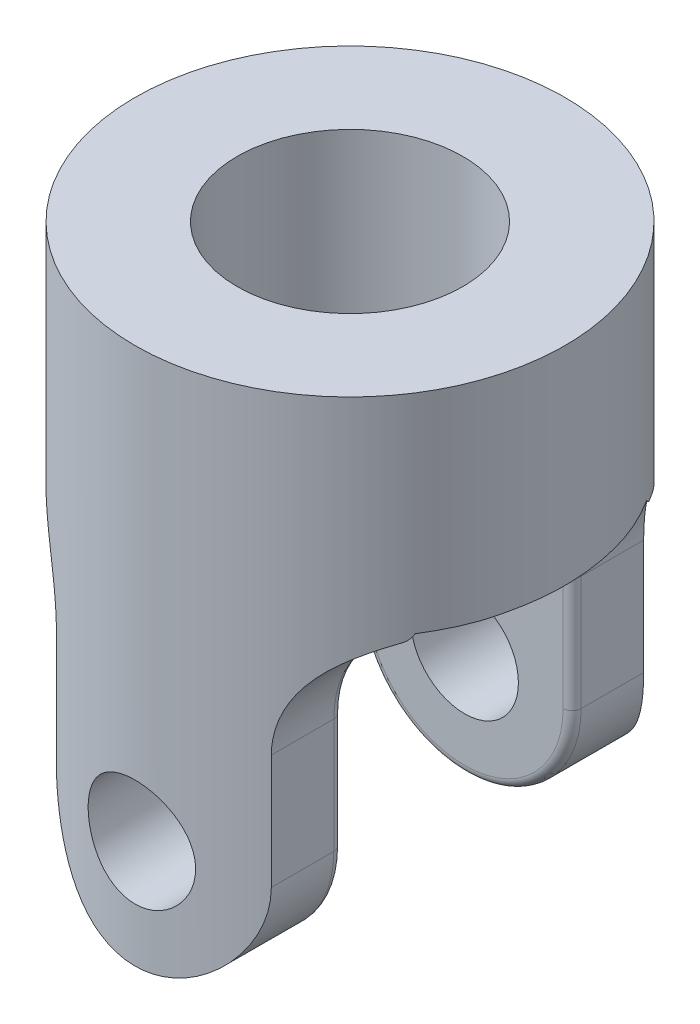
ISO-10303-21;
HEADER;
FILE_DESCRIPTION(('STEP AP214'),'2;1');
FILE_NAME('part.step','',(''),(''),'','','');
FILE_SCHEMA(('AUTOMOTIVE_DESIGN { 1 0 10303 214 1 1 1 1 }'));
ENDSEC;
DATA;
#1=APPLICATION_CONTEXT('core data for automotive mechanical design processes');
#2=APPLICATION_PROTOCOL_DEFINITION('international standard','automotive_design',2000,#1);
#3=PRODUCT_CONTEXT('',#1,'mechanical');
#4=PRODUCT('Part','Part','',(#3));
#5=PRODUCT_RELATED_PRODUCT_CATEGORY('part','',(#4));
#6=PRODUCT_DEFINITION_FORMATION('','',#4);
#7=PRODUCT_DEFINITION_CONTEXT('part definition',#1,'design');
#8=PRODUCT_DEFINITION('design','',#6,#7);
#9=PRODUCT_DEFINITION_SHAPE('','',#8);
#10=(LENGTH_UNIT() NAMED_UNIT(*) SI_UNIT(.MILLI.,.METRE.));
#11=(NAMED_UNIT(*) PLANE_ANGLE_UNIT() SI_UNIT($,.RADIAN.));
#12=(NAMED_UNIT(*) SI_UNIT($,.STERADIAN.) SOLID_ANGLE_UNIT());
#13=UNCERTAINTY_MEASURE_WITH_UNIT(LENGTH_MEASURE(1.E-05),#10,'distance_accuracy_value','');
#14=(GEOMETRIC_REPRESENTATION_CONTEXT(3) GLOBAL_UNCERTAINTY_ASSIGNED_CONTEXT((#13)) GLOBAL_UNIT_ASSIGNED_CONTEXT((#10,
#11,#12)) REPRESENTATION_CONTEXT('',''));
#15=CARTESIAN_POINT('',(0.,0.,0.));
#16=DIRECTION('',(0.,0.,1.));
#17=DIRECTION('',(1.,0.,0.));
#18=AXIS2_PLACEMENT_3D('',#15,#16,#17);
#19=CARTESIAN_POINT('',(0.,47.625,0.));
#20=DIRECTION('',(0.,-1.,0.));
#21=DIRECTION('',(0.,0.,-1.));
#22=AXIS2_PLACEMENT_3D('',#19,#20,#21);
#23=CYLINDRICAL_SURFACE('',#22,19.05);
#24=CARTESIAN_POINT('',(0.,14.2875,-19.05));
#25=CARTESIAN_POINT('',(-0.263131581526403,14.2874926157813,-19.0499955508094));
#26=CARTESIAN_POINT('',(-0.526345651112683,14.2656193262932,-19.0444938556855));
#27=CARTESIAN_POINT('',(-1.04523007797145,14.1788351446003,-19.0230796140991));
#28=CARTESIAN_POINT('',(-1.3008960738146,14.1138998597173,-19.0071611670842));
#29=CARTESIAN_POINT('',(-1.79711626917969,13.9432053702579,-18.966676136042));
#30=CARTESIAN_POINT('',(-2.03768821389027,13.837495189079,-18.9421199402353));
#31=CARTESIAN_POINT('',(-2.49768401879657,13.5884240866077,-18.886974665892));
#32=CARTESIAN_POINT('',(-2.71710716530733,13.4450618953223,-18.8563853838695));
#33=CARTESIAN_POINT('',(-3.13309611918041,13.121637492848,-18.7917903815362));
#34=CARTESIAN_POINT('',(-3.32916431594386,12.940945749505,-18.757731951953));
#35=CARTESIAN_POINT('',(-3.68855284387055,12.5493392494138,-18.6903874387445));
#36=CARTESIAN_POINT('',(-3.85186947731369,12.3384210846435,-18.6571014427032));
#37=CARTESIAN_POINT('',(-4.14345927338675,11.8884851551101,-18.5945391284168));
#38=CARTESIAN_POINT('',(-4.27117578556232,11.6490964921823,-18.5653297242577));
#39=CARTESIAN_POINT('',(-4.48436018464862,11.1513987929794,-18.514996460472));
#40=CARTESIAN_POINT('',(-4.56983482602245,10.8930927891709,-18.4938713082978));
#41=CARTESIAN_POINT('',(-4.69441160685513,10.3703643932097,-18.4626401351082));
#42=CARTESIAN_POINT('',(-4.73440845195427,10.1061682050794,-18.4523218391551));
#43=CARTESIAN_POINT('',(-4.76968113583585,9.5746297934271,-18.443237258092));
#44=CARTESIAN_POINT('',(-4.76496425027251,9.30728808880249,-18.4444690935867));
#45=CARTESIAN_POINT('',(-4.71165721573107,8.78390481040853,-18.4581547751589));
#46=CARTESIAN_POINT('',(-4.66413323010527,8.52774640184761,-18.4703359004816));
#47=CARTESIAN_POINT('',(-4.52826179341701,8.02715866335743,-18.5041130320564));
#48=CARTESIAN_POINT('',(-4.43991143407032,7.78273017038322,-18.5257097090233));
#49=CARTESIAN_POINT('',(-4.22398659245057,7.30968179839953,-18.5761348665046));
#50=CARTESIAN_POINT('',(-4.09602516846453,7.08124640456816,-18.6050341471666));
#51=CARTESIAN_POINT('',(-3.80478117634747,6.64870809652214,-18.6667683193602));
#52=CARTESIAN_POINT('',(-3.64149242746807,6.44460944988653,-18.6996038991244));
#53=CARTESIAN_POINT('',(-3.27870637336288,6.06042852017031,-18.7666592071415));
#54=CARTESIAN_POINT('',(-3.07830936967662,5.88119699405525,-18.8008917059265));
#55=CARTESIAN_POINT('',(-2.64989283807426,5.55872255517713,-18.8660394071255));
#56=CARTESIAN_POINT('',(-2.42187246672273,5.4154807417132,-18.8969545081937));
#57=CARTESIAN_POINT('',(-1.94346794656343,5.1687393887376,-18.9521379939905));
#58=CARTESIAN_POINT('',(-1.69300967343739,5.06537804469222,-18.9763831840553));
#59=CARTESIAN_POINT('',(-1.17753132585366,4.90246255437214,-19.0153263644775));
#60=CARTESIAN_POINT('',(-0.912514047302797,4.84290002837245,-19.0300261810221));
#61=CARTESIAN_POINT('',(-0.382714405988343,4.77057222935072,-19.0479521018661));
#62=CARTESIAN_POINT('',(-0.118099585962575,4.75664839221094,-19.0514621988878));
#63=CARTESIAN_POINT('',(0.40967937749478,4.7728155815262,-19.0474220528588));
#64=CARTESIAN_POINT('',(0.672843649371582,4.80290264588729,-19.0398728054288));
#65=CARTESIAN_POINT('',(1.18622530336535,4.90528263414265,-19.0147442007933));
#66=CARTESIAN_POINT('',(1.43657675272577,4.97694351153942,-18.9973151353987));
#67=CARTESIAN_POINT('',(1.92169190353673,5.15971499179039,-18.9543914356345));
#68=CARTESIAN_POINT('',(2.15645402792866,5.2708295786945,-18.928895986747));
#69=CARTESIAN_POINT('',(2.6083359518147,5.53159970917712,-18.8719875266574));
#70=CARTESIAN_POINT('',(2.82506877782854,5.68190415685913,-18.8404775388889));
#71=CARTESIAN_POINT('',(3.2306469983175,6.01595796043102,-18.7751881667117));
#72=CARTESIAN_POINT('',(3.41948756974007,6.19971308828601,-18.7414083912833));
#73=CARTESIAN_POINT('',(3.76869505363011,6.60083122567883,-18.6743643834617));
#74=CARTESIAN_POINT('',(3.92824927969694,6.8189084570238,-18.6411331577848));
#75=CARTESIAN_POINT('',(4.20849665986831,7.27942611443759,-18.5798738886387));
#76=CARTESIAN_POINT('',(4.32919153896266,7.52186545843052,-18.5518456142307));
#77=CARTESIAN_POINT('',(4.5273957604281,8.02292566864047,-18.5044745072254));
#78=CARTESIAN_POINT('',(4.60516095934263,8.28144021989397,-18.4850803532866));
#79=CARTESIAN_POINT('',(4.71597247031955,8.80843310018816,-18.4571241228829));
#80=CARTESIAN_POINT('',(4.74902856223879,9.07690923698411,-18.448559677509));
#81=CARTESIAN_POINT('',(4.7689725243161,9.60793425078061,-18.4434131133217));
#82=CARTESIAN_POINT('',(4.75715932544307,9.87043185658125,-18.4464938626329));
#83=CARTESIAN_POINT('',(4.69067285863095,10.3895648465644,-18.4635111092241));
#84=CARTESIAN_POINT('',(4.63600045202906,10.6462003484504,-18.4774473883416));
#85=CARTESIAN_POINT('',(4.48605693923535,11.1449118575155,-18.5144175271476));
#86=CARTESIAN_POINT('',(4.39102945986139,11.3870654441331,-18.5373967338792));
#87=CARTESIAN_POINT('',(4.16326610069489,11.8521650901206,-18.5898712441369));
#88=CARTESIAN_POINT('',(4.03052499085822,12.0751084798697,-18.6193674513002));
#89=CARTESIAN_POINT('',(3.72703010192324,12.5017359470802,-18.6825138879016));
#90=CARTESIAN_POINT('',(3.5553750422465,12.7047659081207,-18.7162524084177));
#91=CARTESIAN_POINT('',(3.18068125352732,13.0795618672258,-18.7835548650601));
#92=CARTESIAN_POINT('',(2.97763508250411,13.2513204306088,-18.8171187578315));
#93=CARTESIAN_POINT('',(2.54148458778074,13.5617309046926,-18.8810155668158));
#94=CARTESIAN_POINT('',(2.30790249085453,13.6997268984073,-18.911278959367));
#95=CARTESIAN_POINT('',(1.82011973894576,13.9342731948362,-18.9644313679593));
#96=CARTESIAN_POINT('',(1.56593401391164,14.0308531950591,-18.9873256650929));
#97=CARTESIAN_POINT('',(1.09350255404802,14.1654905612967,-19.0197758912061));
#98=CARTESIAN_POINT('',(0.877507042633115,14.2111451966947,-19.0310320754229));
#99=CARTESIAN_POINT('',(0.441026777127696,14.2721518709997,-19.0461457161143));
#100=CARTESIAN_POINT('',(0.220542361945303,14.2875061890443,-19.0500037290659));
#101=CARTESIAN_POINT('',(0.,14.2875,-19.05));
#102=B_SPLINE_CURVE_WITH_KNOTS('',3,(#24,#25,#26,#27,#28,#29,#30,#31,#32,#33,#34,#35,#36,#37,
#38,#39,#40,#41,#42,#43,#44,#45,#46,#47,#48,#49,#50,#51,#52,#53,#54,#55,#56,#57,#58,#59,#60,#61,
#62,#63,#64,#65,#66,#67,#68,#69,#70,#71,#72,#73,#74,#75,#76,#77,#78,#79,#80,#81,#82,#83,#84,#85,
#86,#87,#88,#89,#90,#91,#92,#93,#94,#95,#96,#97,#98,#99,#100,#101),.UNSPECIFIED.,.T.,.F.,(4,2,2,
2,2,2,2,2,2,2,2,2,2,2,2,2,2,2,2,2,2,2,2,2,2,2,2,2,2,2,2,2,2,2,2,2,2,2,4),(0.,0.788586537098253,
1.57762015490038,2.36570806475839,3.15382256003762,3.95650832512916,4.75928466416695,
5.57398705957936,6.38855914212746,7.18681236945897,7.98493571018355,8.76371428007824,
9.54254833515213,10.3292442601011,11.1160779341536,11.9253476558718,12.7346420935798,
13.5467162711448,14.3586350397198,15.1497763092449,15.940846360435,16.7201937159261,
17.4996197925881,18.2928764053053,19.08627002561,19.8991381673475,20.7119702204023,
21.5199040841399,22.3276611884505,23.1122150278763,23.8967531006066,24.6766207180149,
25.4565965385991,26.2569190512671,27.0574315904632,27.8724418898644,28.6868668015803,
29.3478662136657,30.008815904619),.UNSPECIFIED.);
#103=CARTESIAN_POINT('',(0.,14.2875,-19.05));
#104=VERTEX_POINT('',#103);
#105=EDGE_CURVE('E278',#104,#104,#102,.T.);
#106=ORIENTED_EDGE('',*,*,#105,.T.);
#107=EDGE_LOOP('',(#106));
#108=FACE_BOUND('',#107,.T.);
#109=CARTESIAN_POINT('',(4.76250000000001,9.52500000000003,18.4450831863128));
#110=CARTESIAN_POINT('',(4.76249252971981,9.26201331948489,18.4450882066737));
#111=CARTESIAN_POINT('',(4.74064249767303,8.99894396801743,18.4507690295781));
#112=CARTESIAN_POINT('',(4.65395905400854,8.48035976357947,18.4728204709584));
#113=CARTESIAN_POINT('',(4.58910062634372,8.22484939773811,18.4891973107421));
#114=CARTESIAN_POINT('',(4.41863073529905,7.72895925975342,18.5306727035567));
#115=CARTESIAN_POINT('',(4.31307188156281,7.48856041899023,18.5557599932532));
#116=CARTESIAN_POINT('',(4.06435777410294,7.02885782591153,18.6118155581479));
#117=CARTESIAN_POINT('',(3.92120092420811,6.80955496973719,18.6427840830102));
#118=CARTESIAN_POINT('',(3.59798955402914,6.39344356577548,18.7078756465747));
#119=CARTESIAN_POINT('',(3.41725927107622,6.19716769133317,18.7420490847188));
#120=CARTESIAN_POINT('',(3.02548683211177,5.83737454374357,18.8092627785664));
#121=CARTESIAN_POINT('',(2.81444184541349,5.67386033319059,18.8423029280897));
#122=CARTESIAN_POINT('',(2.36438160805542,5.38205273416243,18.9040849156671));
#123=CARTESIAN_POINT('',(2.12501716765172,5.25428263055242,18.9327603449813));
#124=CARTESIAN_POINT('',(1.62737136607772,5.04099262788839,18.98200696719));
#125=CARTESIAN_POINT('',(1.36909280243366,4.95546649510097,19.0025793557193));
#126=CARTESIAN_POINT('',(0.846503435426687,4.83079837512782,19.0329456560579));
#127=CARTESIAN_POINT('',(0.58242083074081,4.79075182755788,19.0429494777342));
#128=CARTESIAN_POINT('',(0.0511089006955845,4.75534028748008,19.0517829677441));
#129=CARTESIAN_POINT('',(-0.216119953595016,4.75996868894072,19.0506142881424));
#130=CARTESIAN_POINT('',(-0.739865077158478,4.81312508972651,19.0373907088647));
#131=CARTESIAN_POINT('',(-0.996487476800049,4.86067669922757,19.0255779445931));
#132=CARTESIAN_POINT('',(-1.49798840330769,4.99676026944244,18.992675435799));
#133=CARTESIAN_POINT('',(-1.74286630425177,5.08529441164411,18.9715851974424));
#134=CARTESIAN_POINT('',(-2.21649942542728,5.30161989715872,18.9221270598));
#135=CARTESIAN_POINT('',(-2.44508897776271,5.4297587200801,18.8936951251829));
#136=CARTESIAN_POINT('',(-2.87786265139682,5.72139256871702,18.8326376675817));
#137=CARTESIAN_POINT('',(-3.08204251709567,5.88489374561,18.8000114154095));
#138=CARTESIAN_POINT('',(-3.46602384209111,6.24784515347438,18.733078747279));
#139=CARTESIAN_POINT('',(-3.6450159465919,6.44814856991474,18.698750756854));
#140=CARTESIAN_POINT('',(-3.9670499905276,6.87628794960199,18.6330915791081));
#141=CARTESIAN_POINT('',(-4.11009024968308,7.10412519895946,18.6017605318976));
#142=CARTESIAN_POINT('',(-4.35667846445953,7.58245251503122,18.5455654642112));
#143=CARTESIAN_POINT('',(-4.46003156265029,7.83304706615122,18.5207335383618));
#144=CARTESIAN_POINT('',(-4.62289026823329,8.34882531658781,18.4807600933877));
#145=CARTESIAN_POINT('',(-4.68240525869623,8.61400588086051,18.4656165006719));
#146=CARTESIAN_POINT('',(-4.75455546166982,9.14392285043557,18.4471695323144));
#147=CARTESIAN_POINT('',(-4.76838735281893,9.4084859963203,18.4435639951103));
#148=CARTESIAN_POINT('',(-4.75205486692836,9.93614078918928,18.4477788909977));
#149=CARTESIAN_POINT('',(-4.72189453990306,10.1992325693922,18.4555982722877));
#150=CARTESIAN_POINT('',(-4.61948300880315,10.7120326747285,18.48149241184));
#151=CARTESIAN_POINT('',(-4.54792855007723,10.9618895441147,18.4993972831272));
#152=CARTESIAN_POINT('',(-4.36553244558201,11.4460619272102,18.5432836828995));
#153=CARTESIAN_POINT('',(-4.25468614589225,11.6803755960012,18.5692661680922));
#154=CARTESIAN_POINT('',(-3.99434812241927,12.1318806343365,18.6270164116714));
#155=CARTESIAN_POINT('',(-3.8441409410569,12.3486459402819,18.6588876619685));
#156=CARTESIAN_POINT('',(-3.5102496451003,12.7543338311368,18.7245704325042));
#157=CARTESIAN_POINT('',(-3.32656002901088,12.9432518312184,18.7583822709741));
#158=CARTESIAN_POINT('',(-2.92542620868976,13.2927300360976,18.8251605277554));
#159=CARTESIAN_POINT('',(-2.70725242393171,13.4524624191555,18.8580846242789));
#160=CARTESIAN_POINT('',(-2.24648402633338,13.7330228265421,18.9185019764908));
#161=CARTESIAN_POINT('',(-2.00389068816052,13.8538528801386,18.9459955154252));
#162=CARTESIAN_POINT('',(-1.50284593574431,14.0521296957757,18.9922807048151));
#163=CARTESIAN_POINT('',(-1.24452402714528,14.1298884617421,19.0111347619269));
#164=CARTESIAN_POINT('',(-0.717945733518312,14.240751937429,19.0382898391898));
#165=CARTESIAN_POINT('',(-0.4496912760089,14.2738652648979,19.0465928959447));
#166=CARTESIAN_POINT('',(0.0813602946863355,14.2940131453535,19.0516273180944));
#167=CARTESIAN_POINT('',(0.344108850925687,14.2822693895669,19.0486654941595));
#168=CARTESIAN_POINT('',(0.86376270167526,14.2158347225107,19.0321833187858));
#169=CARTESIAN_POINT('',(1.12066816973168,14.1611450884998,19.0186632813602));
#170=CARTESIAN_POINT('',(1.62006455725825,14.0110263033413,18.9826312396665));
#171=CARTESIAN_POINT('',(1.86262563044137,13.9158180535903,18.9601680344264));
#172=CARTESIAN_POINT('',(2.32846746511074,13.6875651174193,18.908615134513));
#173=CARTESIAN_POINT('',(2.55174579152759,13.5545156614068,18.8795246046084));
#174=CARTESIAN_POINT('',(2.97847668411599,13.2506311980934,18.8169827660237));
#175=CARTESIAN_POINT('',(3.18132613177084,13.0789673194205,18.7834436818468));
#176=CARTESIAN_POINT('',(3.55575403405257,12.7043361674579,18.7161796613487));
#177=CARTESIAN_POINT('',(3.72732454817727,12.5013609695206,18.6824546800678));
#178=CARTESIAN_POINT('',(4.03746665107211,12.0653107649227,18.6179210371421));
#179=CARTESIAN_POINT('',(4.17536289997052,11.831744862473,18.5871785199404));
#180=CARTESIAN_POINT('',(4.40972684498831,11.3440107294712,18.5329808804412));
#181=CARTESIAN_POINT('',(4.50622468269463,11.0898576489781,18.5095204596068));
#182=CARTESIAN_POINT('',(4.6406872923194,10.6176269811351,18.4762096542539));
#183=CARTESIAN_POINT('',(4.68626747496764,10.401808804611,18.4646250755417));
#184=CARTESIAN_POINT('',(4.74717566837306,9.96567951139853,18.4490600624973));
#185=CARTESIAN_POINT('',(4.76250625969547,9.74536877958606,18.4450789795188));
#186=CARTESIAN_POINT('',(4.76250000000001,9.52500000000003,18.4450831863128));
#187=B_SPLINE_CURVE_WITH_KNOTS('',3,(#109,#110,#111,#112,#113,#114,#115,#116,#117,#118,#119,
#120,#121,#122,#123,#124,#125,#126,#127,#128,#129,#130,#131,#132,#133,#134,#135,#136,#137,#138,
#139,#140,#141,#142,#143,#144,#145,#146,#147,#148,#149,#150,#151,#152,#153,#154,#155,#156,#157,
#158,#159,#160,#161,#162,#163,#164,#165,#166,#167,#168,#169,#170,#171,#172,#173,#174,#175,#176,
#177,#178,#179,#180,#181,#182,#183,#184,#185,#186),.UNSPECIFIED.,.T.,.F.,(4,2,2,2,2,2,2,2,2,2,2,
2,2,2,2,2,2,2,2,2,2,2,2,2,2,2,2,2,2,2,2,2,2,2,2,2,2,2,4),(0.,0.788150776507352,1.57676038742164,
2.3643540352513,3.15198112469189,3.95523632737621,4.75856658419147,5.57310600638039,
6.38752519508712,7.18544570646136,7.9832482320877,8.76334790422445,9.54348910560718,
10.3306792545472,11.1180064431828,11.9266423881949,12.7353161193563,13.5479110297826,
14.3603319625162,15.1512950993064,15.9421854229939,16.7201355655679,17.4981778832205,
18.2914832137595,19.0849190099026,19.8982075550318,20.7114536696,21.5187289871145,
22.3258484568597,23.1111446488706,23.896417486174,24.677462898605,25.4586067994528,
26.258464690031,27.0585253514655,27.8735118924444,28.6879040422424,29.3483886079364,
30.0088168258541),.UNSPECIFIED.);
#188=CARTESIAN_POINT('',(4.76250000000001,9.52500000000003,18.4450831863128));
#189=VERTEX_POINT('',#188);
#190=EDGE_CURVE('E286',#189,#189,#187,.T.);
#191=ORIENTED_EDGE('',*,*,#190,.T.);
#192=EDGE_LOOP('',(#191));
#193=FACE_BOUND('',#192,.T.);
#194=CARTESIAN_POINT('',(0.,47.625,0.));
#195=DIRECTION('',(0.,1.,0.));
#196=DIRECTION('',(0.,0.,1.));
#197=AXIS2_PLACEMENT_3D('',#194,#195,#196);
#198=CIRCLE('',#197,19.05);
#199=CARTESIAN_POINT('',(0.,47.625,19.05));
#200=VERTEX_POINT('',#199);
#201=EDGE_CURVE('E204',#200,#200,#198,.T.);
#202=ORIENTED_EDGE('',*,*,#201,.F.);
#203=EDGE_LOOP('',(#202));
#204=FACE_BOUND('',#203,.T.);
#205=CARTESIAN_POINT('',(0.,29.1452388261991,0.));
#206=DIRECTION('',(0.,1.,0.));
#207=DIRECTION('',(0.,0.,1.));
#208=AXIS2_PLACEMENT_3D('',#205,#206,#207);
#209=CIRCLE('',#208,19.05);
#210=CARTESIAN_POINT('',(-17.9411689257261,29.1452388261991,6.40444826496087));
#211=VERTEX_POINT('',#210);
#212=CARTESIAN_POINT('',(-16.0465941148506,29.1452388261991,10.2669039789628));
#213=VERTEX_POINT('',#212);
#214=EDGE_CURVE('E189',#211,#213,#209,.T.);
#215=ORIENTED_EDGE('',*,*,#214,.T.);
#216=CARTESIAN_POINT('',(-16.0465941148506,29.1452388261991,10.2669039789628));
#217=CARTESIAN_POINT('',(-16.0372768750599,29.1157831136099,10.2814663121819));
#218=CARTESIAN_POINT('',(-16.0271745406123,29.0872011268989,10.2972119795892));
#219=CARTESIAN_POINT('',(-16.0055557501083,29.0318945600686,10.3307833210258));
#220=CARTESIAN_POINT('',(-15.9940408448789,29.0051679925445,10.3486067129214));
#221=CARTESIAN_POINT('',(-15.9576708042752,28.9280401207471,10.4046726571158));
#222=CARTESIAN_POINT('',(-15.9309167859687,28.8804640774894,10.4456265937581));
#223=CARTESIAN_POINT('',(-15.8742304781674,28.7948098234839,10.5315660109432));
#224=CARTESIAN_POINT('',(-15.8444182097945,28.7564886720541,10.5763928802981));
#225=CARTESIAN_POINT('',(-15.7816164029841,28.6878878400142,10.6698758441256));
#226=CARTESIAN_POINT('',(-15.7486256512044,28.6576112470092,10.7185333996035));
#227=CARTESIAN_POINT('',(-15.6930675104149,28.6155571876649,10.7996090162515));
#228=CARTESIAN_POINT('',(-15.6712796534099,28.6011148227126,10.8312051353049));
#229=CARTESIAN_POINT('',(-15.6268999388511,28.5758198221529,10.8951372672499));
#230=CARTESIAN_POINT('',(-15.6043100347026,28.5649590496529,10.9274714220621));
#231=CARTESIAN_POINT('',(-15.5813577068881,28.5559720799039,10.9601));
#232=B_SPLINE_CURVE_WITH_KNOTS('',3,(#216,#217,#218,#219,#220,#221,#222,#223,#224,#225,#226,
#227,#228,#229,#230,#231),.UNSPECIFIED.,.F.,.F.,(4,2,2,2,2,2,2,4),(0.,0.102363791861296,
0.204616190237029,0.408337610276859,0.605922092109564,0.803582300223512,0.926449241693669,
1.04903509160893),.UNSPECIFIED.);
#233=CARTESIAN_POINT('',(-15.5813577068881,28.5559720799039,10.9601));
#234=VERTEX_POINT('',#233);
#235=EDGE_CURVE('E369',#213,#234,#232,.T.);
#236=ORIENTED_EDGE('',*,*,#235,.T.);
#237=CARTESIAN_POINT('',(-9.525,19.685,-16.4977839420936));
#238=CARTESIAN_POINT('',(-9.52496088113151,19.918350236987,-16.4977688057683));
#239=CARTESIAN_POINT('',(-9.53357353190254,20.1516967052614,-16.4928328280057));
#240=CARTESIAN_POINT('',(-9.56782146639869,20.6166980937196,-16.4730087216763));
#241=CARTESIAN_POINT('',(-9.59345572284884,20.8483531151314,-16.4581211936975));
#242=CARTESIAN_POINT('',(-9.66141942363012,21.3080009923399,-16.4183108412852));
#243=CARTESIAN_POINT('',(-9.70372594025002,21.5359984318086,-16.3934017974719));
#244=CARTESIAN_POINT('',(-9.80447669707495,21.9870210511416,-16.3333461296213));
#245=CARTESIAN_POINT('',(-9.86292069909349,22.2100463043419,-16.2981996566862));
#246=CARTESIAN_POINT('',(-9.99521577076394,22.6496636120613,-16.217402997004));
#247=CARTESIAN_POINT('',(-10.0690752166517,22.8662520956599,-16.1717470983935));
#248=CARTESIAN_POINT('',(-10.2311827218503,23.2913603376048,-16.0696785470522));
#249=CARTESIAN_POINT('',(-10.3194309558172,23.4998799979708,-16.0132657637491));
#250=CARTESIAN_POINT('',(-10.5090589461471,23.9073731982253,-15.8894615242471));
#251=CARTESIAN_POINT('',(-10.6104339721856,24.1063501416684,-15.8220740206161));
#252=CARTESIAN_POINT('',(-10.8249101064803,24.4935871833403,-15.676116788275));
#253=CARTESIAN_POINT('',(-10.9380111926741,24.6818473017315,-15.597547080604));
#254=CARTESIAN_POINT('',(-11.1750060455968,25.0476354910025,-15.4286429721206));
#255=CARTESIAN_POINT('',(-11.2989577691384,25.2250961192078,-15.3382439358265));
#256=CARTESIAN_POINT('',(-11.5553164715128,25.5672655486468,-15.1460495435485));
#257=CARTESIAN_POINT('',(-11.6877234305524,25.7319743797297,-15.044254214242));
#258=CARTESIAN_POINT('',(-11.9591574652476,26.0480960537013,-14.8293967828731));
#259=CARTESIAN_POINT('',(-12.0981857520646,26.1995064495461,-14.7163326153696));
#260=CARTESIAN_POINT('',(-12.3809708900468,26.4887188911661,-14.4792302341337));
#261=CARTESIAN_POINT('',(-12.5247282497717,26.6265194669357,-14.3551908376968));
#262=CARTESIAN_POINT('',(-12.8240785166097,26.8965620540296,-14.0885806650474));
#263=CARTESIAN_POINT('',(-12.9798547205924,27.0279377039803,-13.9453388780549));
#264=CARTESIAN_POINT('',(-13.292575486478,27.2756182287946,-13.6475843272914));
#265=CARTESIAN_POINT('',(-13.44952006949,27.3919228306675,-13.4930713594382));
#266=CARTESIAN_POINT('',(-13.7627279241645,27.6100750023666,-13.1734537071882));
#267=CARTESIAN_POINT('',(-13.91899104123,27.7119194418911,-13.0083467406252));
#268=CARTESIAN_POINT('',(-14.2291584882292,27.9019462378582,-12.6683290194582));
#269=CARTESIAN_POINT('',(-14.3830623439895,27.9901258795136,-12.4934163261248));
#270=CARTESIAN_POINT('',(-14.7634251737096,28.1948863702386,-12.0444336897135));
#271=CARTESIAN_POINT('',(-14.9875078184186,28.3034922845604,-11.7646791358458));
#272=CARTESIAN_POINT('',(-15.4232003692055,28.4957157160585,-11.1874194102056));
#273=CARTESIAN_POINT('',(-15.6348051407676,28.579323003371,-10.8899070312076));
#274=CARTESIAN_POINT('',(-16.0431146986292,28.7255421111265,-10.2789237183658));
#275=CARTESIAN_POINT('',(-16.2397846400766,28.7881059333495,-9.96541815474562));
#276=CARTESIAN_POINT('',(-16.615638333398,28.8957388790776,-9.32528378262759));
#277=CARTESIAN_POINT('',(-16.7948218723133,28.9408077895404,-8.9986548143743));
#278=CARTESIAN_POINT('',(-17.1918461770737,29.029905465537,-8.22145899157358));
#279=CARTESIAN_POINT('',(-17.4021973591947,29.0684013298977,-7.76641658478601));
#280=CARTESIAN_POINT('',(-17.786699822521,29.1278564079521,-6.8401406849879));
#281=CARTESIAN_POINT('',(-17.9608394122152,29.1488099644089,-6.36890201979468));
#282=CARTESIAN_POINT('',(-18.2714417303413,29.1794105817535,-5.41378881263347));
#283=CARTESIAN_POINT('',(-18.4079009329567,29.1890565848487,-4.92991309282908));
#284=CARTESIAN_POINT('',(-18.6421466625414,29.2019870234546,-3.95287775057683));
#285=CARTESIAN_POINT('',(-18.7399368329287,29.205272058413,-3.45971900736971));
#286=CARTESIAN_POINT('',(-18.897358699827,29.2091078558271,-2.4600813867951));
#287=CARTESIAN_POINT('',(-18.9564226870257,29.2096187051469,-1.95351291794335));
#288=CARTESIAN_POINT('',(-19.033752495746,29.2100647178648,-0.93726372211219));
#289=CARTESIAN_POINT('',(-19.0520174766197,29.2099998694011,-0.427582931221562));
#290=CARTESIAN_POINT('',(-19.0476285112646,29.2100001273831,0.591825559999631));
#291=CARTESIAN_POINT('',(-19.0249568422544,29.2100652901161,1.10155318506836));
#292=CARTESIAN_POINT('',(-18.9388075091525,29.2094475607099,2.11754548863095));
#293=CARTESIAN_POINT('',(-18.8753295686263,29.2087646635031,2.62381014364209));
#294=CARTESIAN_POINT('',(-18.7036160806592,29.2041086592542,3.65580332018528));
#295=CARTESIAN_POINT('',(-18.5932233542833,29.1999661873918,4.18117378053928));
#296=CARTESIAN_POINT('',(-18.3285057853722,29.1835599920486,5.2207365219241));
#297=CARTESIAN_POINT('',(-18.1741722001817,29.1712946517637,5.73492655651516));
#298=CARTESIAN_POINT('',(-17.8230306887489,29.1322930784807,6.7475164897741));
#299=CARTESIAN_POINT('',(-17.6262637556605,29.1055707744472,7.24593109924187));
#300=CARTESIAN_POINT('',(-17.1921907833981,29.0296619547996,8.2229157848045));
#301=CARTESIAN_POINT('',(-16.9549063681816,28.9804873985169,8.70149627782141));
#302=CARTESIAN_POINT('',(-16.5317482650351,28.8726944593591,9.47232063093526));
#303=CARTESIAN_POINT('',(-16.356505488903,28.8232353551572,9.77172744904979));
#304=CARTESIAN_POINT('',(-15.9915321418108,28.7076409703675,10.3582119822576));
#305=CARTESIAN_POINT('',(-15.8018055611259,28.6415102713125,10.6452930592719));
#306=CARTESIAN_POINT('',(-15.4100602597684,28.4895738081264,11.2048655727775));
#307=CARTESIAN_POINT('',(-15.2080616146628,28.4037995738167,11.4773795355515));
#308=CARTESIAN_POINT('',(-14.794100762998,28.2093882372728,12.0062371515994));
#309=CARTESIAN_POINT('',(-14.5821407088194,28.1007560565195,12.2625842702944));
#310=CARTESIAN_POINT('',(-14.1961331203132,27.8828084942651,12.7059055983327));
#311=CARTESIAN_POINT('',(-14.0232896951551,27.7782615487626,12.8962780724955));
#312=CARTESIAN_POINT('',(-13.6756323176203,27.5516907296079,13.2643740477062));
#313=CARTESIAN_POINT('',(-13.5008188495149,27.4296710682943,13.4421005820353));
#314=CARTESIAN_POINT('',(-13.1516762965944,27.1671845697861,13.7838888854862));
#315=CARTESIAN_POINT('',(-12.9773471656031,27.0267195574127,13.947952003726));
#316=CARTESIAN_POINT('',(-12.6319391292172,26.726763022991,14.2615225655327));
#317=CARTESIAN_POINT('',(-12.4608602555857,26.5672713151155,14.4110298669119));
#318=CARTESIAN_POINT('',(-12.1237135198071,26.2279198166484,14.6958204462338));
#319=CARTESIAN_POINT('',(-11.9576926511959,26.0479167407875,14.8309890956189));
#320=CARTESIAN_POINT('',(-11.6351953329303,25.6689938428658,15.0853214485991));
#321=CARTESIAN_POINT('',(-11.4787191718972,25.4700734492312,15.2044846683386));
#322=CARTESIAN_POINT('',(-11.1784747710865,25.0543983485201,15.4265708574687));
#323=CARTESIAN_POINT('',(-11.0347050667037,24.8376457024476,15.5294956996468));
#324=CARTESIAN_POINT('',(-10.7628059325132,24.3878782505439,15.7191604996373));
#325=CARTESIAN_POINT('',(-10.6346741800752,24.154865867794,15.8059028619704));
#326=CARTESIAN_POINT('',(-10.4115375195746,23.7046522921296,15.9536199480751));
#327=CARTESIAN_POINT('',(-10.3143937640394,23.4891174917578,16.0164604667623));
#328=CARTESIAN_POINT('',(-10.1355425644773,23.04871010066,16.1302361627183));
#329=CARTESIAN_POINT('',(-10.0538339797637,22.8238382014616,16.181172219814));
#330=CARTESIAN_POINT('',(-9.90713729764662,22.3666546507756,16.2714028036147));
#331=CARTESIAN_POINT('',(-9.84213485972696,22.1343495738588,16.3107073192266));
#332=CARTESIAN_POINT('',(-9.72972257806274,21.6640173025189,16.3780123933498));
#333=CARTESIAN_POINT('',(-9.68230656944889,21.4259921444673,16.4060169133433));
#334=CARTESIAN_POINT('',(-9.60449707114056,20.9383691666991,16.4516946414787));
#335=CARTESIAN_POINT('',(-9.57468865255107,20.6886433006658,16.4690135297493));
#336=CARTESIAN_POINT('',(-9.54488066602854,20.3127872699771,16.48629321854));
#337=CARTESIAN_POINT('',(-9.53742879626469,20.1873921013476,16.4906033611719));
#338=CARTESIAN_POINT('',(-9.52748802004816,19.9363374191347,16.4963477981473));
#339=CARTESIAN_POINT('',(-9.52499919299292,19.8106779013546,16.4977820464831));
#340=CARTESIAN_POINT('',(-9.525,19.685,16.4977839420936));
#341=B_SPLINE_CURVE_WITH_KNOTS('',3,(#237,#238,#239,#240,#241,#242,#243,#244,#245,#246,#247,
#248,#249,#250,#251,#252,#253,#254,#255,#256,#257,#258,#259,#260,#261,#262,#263,#264,#265,#266,
#267,#268,#269,#270,#271,#272,#273,#274,#275,#276,#277,#278,#279,#280,#281,#282,#283,#284,#285,
#286,#287,#288,#289,#290,#291,#292,#293,#294,#295,#296,#297,#298,#299,#300,#301,#302,#303,#304,
#305,#306,#307,#308,#309,#310,#311,#312,#313,#314,#315,#316,#317,#318,#319,#320,#321,#322,#323,
#324,#325,#326,#327,#328,#329,#330,#331,#332,#333,#334,#335,#336,#337,#338,#339,#340),
.UNSPECIFIED.,.F.,.F.,(4,2,2,2,2,2,2,2,2,2,2,2,2,2,2,2,2,2,2,2,2,2,2,2,2,2,2,2,2,2,2,2,2,2,2,2,
2,2,2,2,2,2,2,2,2,2,2,2,2,2,2,4),(0.,0.699834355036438,1.39962647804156,2.09845958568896,
2.79728237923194,3.49648588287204,4.19569787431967,4.89465859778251,5.59361800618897,
6.29656980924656,6.99951996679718,7.70259920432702,8.4057542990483,9.15225685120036,
9.89877292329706,10.6454503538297,11.3922759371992,12.514141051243,13.636464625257,
14.7613310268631,15.8862111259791,17.392458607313,18.899191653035,20.40606563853,
21.9127976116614,23.4411511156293,24.9695361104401,26.4985829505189,28.0276401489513,
29.6362655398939,31.2452112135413,32.852609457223,34.4591525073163,35.50965675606,
36.5598726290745,37.6084144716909,38.6567307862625,39.4886840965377,40.3204371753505,
41.1521080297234,41.9837870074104,42.8216802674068,43.659598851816,44.4974207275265,
45.3351180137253,46.0680642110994,46.8009562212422,47.5332170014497,48.2652208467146,
49.02034913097,49.3973072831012,49.7742714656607),.UNSPECIFIED.);
#342=CARTESIAN_POINT('',(-9.52499999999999,19.685,16.4977839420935));
#343=VERTEX_POINT('',#342);
#344=EDGE_CURVE('E503',#234,#343,#341,.T.);
#345=ORIENTED_EDGE('',*,*,#344,.T.);
#346=DIRECTION('',(0.,-1.,0.));
#347=VECTOR('',#346,1.);
#348=CARTESIAN_POINT('',(-9.52499999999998,47.625,16.4977839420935));
#349=LINE('',#348,#347);
#350=CARTESIAN_POINT('',(-9.525,9.525,16.4977839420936));
#351=VERTEX_POINT('',#350);
#352=EDGE_CURVE('E504',#343,#351,#349,.T.);
#353=ORIENTED_EDGE('',*,*,#352,.T.);
#354=CARTESIAN_POINT('',(9.525,9.52500000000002,16.4977839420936));
#355=CARTESIAN_POINT('',(9.52500093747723,9.40027257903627,16.4977810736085));
#356=CARTESIAN_POINT('',(9.52254955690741,9.27556275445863,16.4991989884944));
#357=CARTESIAN_POINT('',(9.51275833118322,9.02640408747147,16.5048470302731));
#358=CARTESIAN_POINT('',(9.50541869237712,8.90195523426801,16.5090770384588));
#359=CARTESIAN_POINT('',(9.47610793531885,8.52953393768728,16.5259318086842));
#360=CARTESIAN_POINT('',(9.44684491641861,8.28227418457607,16.5427214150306));
#361=CARTESIAN_POINT('',(9.36949132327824,7.7931683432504,16.5866536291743));
#362=CARTESIAN_POINT('',(9.32150961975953,7.55129934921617,16.6137363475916));
#363=CARTESIAN_POINT('',(9.20730560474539,7.07314911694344,16.677298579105));
#364=CARTESIAN_POINT('',(9.14108119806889,6.83686852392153,16.7137791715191));
#365=CARTESIAN_POINT('',(8.99129510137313,6.37194751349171,16.7948306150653));
#366=CARTESIAN_POINT('',(8.90777526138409,6.14329017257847,16.8393819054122));
#367=CARTESIAN_POINT('',(8.72407711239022,5.69420111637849,16.9352799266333));
#368=CARTESIAN_POINT('',(8.62389244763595,5.47377257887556,16.9866292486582));
#369=CARTESIAN_POINT('',(8.29930376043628,4.82601405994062,17.1488381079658));
#370=CARTESIAN_POINT('',(8.0509510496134,4.41247529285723,17.2678097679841));
#371=CARTESIAN_POINT('',(7.47383610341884,3.59736922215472,17.5257462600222));
#372=CARTESIAN_POINT('',(7.14015861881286,3.19954734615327,17.6655504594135));
#373=CARTESIAN_POINT('',(6.59457427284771,2.64718480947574,17.8732248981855));
#374=CARTESIAN_POINT('',(6.40509661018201,2.47038257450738,17.9421446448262));
#375=CARTESIAN_POINT('',(6.01181385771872,2.13237428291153,18.0777156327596));
#376=CARTESIAN_POINT('',(5.80800671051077,1.97117047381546,18.1443665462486));
#377=CARTESIAN_POINT('',(5.37278064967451,1.65505544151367,18.2781569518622));
#378=CARTESIAN_POINT('',(5.14042653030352,1.50131409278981,18.3450225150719));
#379=CARTESIAN_POINT('',(4.66194023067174,1.21417930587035,18.4724136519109));
#380=CARTESIAN_POINT('',(4.41581396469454,1.08077722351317,18.5329419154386));
#381=CARTESIAN_POINT('',(3.91130485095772,0.835583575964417,18.6459377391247));
#382=CARTESIAN_POINT('',(3.65292491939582,0.723786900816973,18.6984072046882));
#383=CARTESIAN_POINT('',(3.1257193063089,0.52305375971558,18.7937250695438));
#384=CARTESIAN_POINT('',(2.85689473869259,0.434114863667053,18.836574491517));
#385=CARTESIAN_POINT('',(2.33040396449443,0.285723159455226,18.9086545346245));
#386=CARTESIAN_POINT('',(2.07330466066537,0.22462268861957,18.9386372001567));
#387=CARTESIAN_POINT('',(1.55394863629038,0.123892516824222,18.9883061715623));
#388=CARTESIAN_POINT('',(1.29169214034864,0.0842618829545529,19.0079929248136));
#389=CARTESIAN_POINT('',(0.764329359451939,0.0270138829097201,19.0364912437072));
#390=CARTESIAN_POINT('',(0.499224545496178,0.00938565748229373,19.0453081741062));
#391=CARTESIAN_POINT('',(-0.0316607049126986,-0.00364684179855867,19.0518227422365));
#392=CARTESIAN_POINT('',(-0.29744109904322,0.00094752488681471,19.0495210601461));
#393=CARTESIAN_POINT('',(-0.804260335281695,0.0309220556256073,19.0345541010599));
#394=CARTESIAN_POINT('',(-1.04543822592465,0.054457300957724,19.0228087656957));
#395=CARTESIAN_POINT('',(-1.52469707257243,0.119714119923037,18.9904047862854));
#396=CARTESIAN_POINT('',(-1.76277824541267,0.161434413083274,18.9697467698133));
#397=CARTESIAN_POINT('',(-2.23423979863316,0.262606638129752,18.9200123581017));
#398=CARTESIAN_POINT('',(-2.46762011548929,0.322058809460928,18.890935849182));
#399=CARTESIAN_POINT('',(-2.92820911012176,0.458088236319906,18.8250425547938));
#400=CARTESIAN_POINT('',(-3.15541756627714,0.534666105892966,18.7882254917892));
#401=CARTESIAN_POINT('',(-3.605393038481,0.705394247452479,18.7071268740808));
#402=CARTESIAN_POINT('',(-3.82805781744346,0.799769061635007,18.662750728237));
#403=CARTESIAN_POINT('',(-4.26455258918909,1.00458926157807,18.5678772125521));
#404=CARTESIAN_POINT('',(-4.47837941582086,1.1150403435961,18.51737767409));
#405=CARTESIAN_POINT('',(-5.10493628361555,1.46924131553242,18.3583058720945));
#406=CARTESIAN_POINT('',(-5.50300713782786,1.73594015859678,18.2421108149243));
#407=CARTESIAN_POINT('',(-6.28824042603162,2.35173975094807,17.987406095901));
#408=CARTESIAN_POINT('',(-6.6708215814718,2.7062441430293,17.8478253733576));
#409=CARTESIAN_POINT('',(-7.19758780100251,3.2809538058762,17.6389667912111));
#410=CARTESIAN_POINT('',(-7.36544169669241,3.47985996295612,17.5693768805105));
#411=CARTESIAN_POINT('',(-7.6846691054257,3.8912417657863,17.4321111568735));
#412=CARTESIAN_POINT('',(-7.83604008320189,4.10371949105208,17.3644356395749));
#413=CARTESIAN_POINT('',(-8.13051871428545,4.55533319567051,17.2286143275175));
#414=CARTESIAN_POINT('',(-8.27246277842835,4.79530464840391,17.1607200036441));
#415=CARTESIAN_POINT('',(-8.53533313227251,5.28806294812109,17.0315012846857));
#416=CARTESIAN_POINT('',(-8.656269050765,5.5408438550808,16.9701738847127));
#417=CARTESIAN_POINT('',(-8.8757753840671,6.05731622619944,16.8564046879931));
#418=CARTESIAN_POINT('',(-8.9743858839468,6.32098711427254,16.8039470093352));
#419=CARTESIAN_POINT('',(-9.14827185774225,6.85774586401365,16.7099199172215));
#420=CARTESIAN_POINT('',(-9.22355744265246,7.13082958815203,16.6683457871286));
#421=CARTESIAN_POINT('',(-9.3259727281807,7.57995506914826,16.6111629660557));
#422=CARTESIAN_POINT('',(-9.36056268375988,7.75384156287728,16.5916705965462));
#423=CARTESIAN_POINT('',(-9.42003837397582,8.10374181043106,16.5579753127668));
#424=CARTESIAN_POINT('',(-9.44492679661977,8.27975496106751,16.5437709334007));
#425=CARTESIAN_POINT('',(-9.48486650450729,8.63355937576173,16.5209069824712));
#426=CARTESIAN_POINT('',(-9.49990078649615,8.81135317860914,16.5122569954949));
#427=CARTESIAN_POINT('',(-9.51997579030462,9.16776164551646,16.5006843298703));
#428=CARTESIAN_POINT('',(-9.52501242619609,9.34637661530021,16.4977639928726));
#429=CARTESIAN_POINT('',(-9.525,9.525,16.4977839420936));
#430=B_SPLINE_CURVE_WITH_KNOTS('',3,(#354,#355,#356,#357,#358,#359,#360,#361,#362,#363,#364,
#365,#366,#367,#368,#369,#370,#371,#372,#373,#374,#375,#376,#377,#378,#379,#380,#381,#382,#383,
#384,#385,#386,#387,#388,#389,#390,#391,#392,#393,#394,#395,#396,#397,#398,#399,#400,#401,#402,
#403,#404,#405,#406,#407,#408,#409,#410,#411,#412,#413,#414,#415,#416,#417,#418,#419,#420,#421,
#422,#423,#424,#425,#426,#427,#428,#429),.UNSPECIFIED.,.F.,.F.,(4,2,2,2,2,2,2,2,2,2,2,2,2,2,2,2,
2,2,2,2,2,2,2,2,2,2,2,2,2,2,2,2,2,2,2,2,2,4),(0.,0.374115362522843,0.748214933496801,
1.49577871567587,2.23905786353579,2.98242241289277,3.72400882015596,4.46587871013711,
5.95045512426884,7.55645263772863,8.36024673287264,9.16415647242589,10.0226343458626,
10.8807463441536,11.7386551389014,12.5964726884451,13.3932583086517,14.1900093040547,
14.9863669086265,15.7826757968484,16.5096401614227,17.2365533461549,17.9634763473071,
18.6904254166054,19.4272479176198,20.1643321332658,21.6376476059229,23.250115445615,
24.0576502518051,24.8653090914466,25.725087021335,26.5844698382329,27.4422971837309,
28.2997521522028,28.8345228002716,29.3691451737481,29.9046876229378,30.4404488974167),.UNSPECIFIED.);
#431=CARTESIAN_POINT('',(9.525,9.52500000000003,16.4977839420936));
#432=VERTEX_POINT('',#431);
#433=EDGE_CURVE('E246',#432,#351,#430,.T.);
#434=ORIENTED_EDGE('',*,*,#433,.F.);
#435=DIRECTION('',(0.,-1.,0.));
#436=VECTOR('',#435,1.);
#437=CARTESIAN_POINT('',(9.52500000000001,47.625,16.4977839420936));
#438=LINE('',#437,#436);
#439=CARTESIAN_POINT('',(9.52500000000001,19.685,16.4977839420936));
#440=VERTEX_POINT('',#439);
#441=EDGE_CURVE('E202',#440,#432,#438,.T.);
#442=ORIENTED_EDGE('',*,*,#441,.F.);
#443=CARTESIAN_POINT('',(9.525,19.685,-16.4977839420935));
#444=CARTESIAN_POINT('',(9.52496088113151,19.9183502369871,-16.4977688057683));
#445=CARTESIAN_POINT('',(9.53357353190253,20.1516967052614,-16.4928328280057));
#446=CARTESIAN_POINT('',(9.56782146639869,20.6166980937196,-16.4730087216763));
#447=CARTESIAN_POINT('',(9.59345572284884,20.8483531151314,-16.4581211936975));
#448=CARTESIAN_POINT('',(9.66141942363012,21.3080009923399,-16.4183108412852));
#449=CARTESIAN_POINT('',(9.70372594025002,21.5359984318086,-16.3934017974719));
#450=CARTESIAN_POINT('',(9.80447669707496,21.9870210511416,-16.3333461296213));
#451=CARTESIAN_POINT('',(9.8629206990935,22.2100463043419,-16.2981996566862));
#452=CARTESIAN_POINT('',(9.99521577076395,22.6496636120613,-16.217402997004));
#453=CARTESIAN_POINT('',(10.0690752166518,22.8662520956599,-16.1717470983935));
#454=CARTESIAN_POINT('',(10.2311827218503,23.2913603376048,-16.0696785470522));
#455=CARTESIAN_POINT('',(10.3194309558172,23.4998799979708,-16.0132657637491));
#456=CARTESIAN_POINT('',(10.5090589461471,23.9073731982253,-15.8894615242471));
#457=CARTESIAN_POINT('',(10.6104339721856,24.1063501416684,-15.8220740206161));
#458=CARTESIAN_POINT('',(10.8249101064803,24.4935871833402,-15.676116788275));
#459=CARTESIAN_POINT('',(10.9380111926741,24.6818473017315,-15.5975470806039));
#460=CARTESIAN_POINT('',(11.1750060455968,25.0476354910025,-15.4286429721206));
#461=CARTESIAN_POINT('',(11.2989577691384,25.2250961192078,-15.3382439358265));
#462=CARTESIAN_POINT('',(11.5553164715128,25.5672655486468,-15.1460495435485));
#463=CARTESIAN_POINT('',(11.6877234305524,25.7319743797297,-15.044254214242));
#464=CARTESIAN_POINT('',(11.9591574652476,26.0480960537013,-14.8293967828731));
#465=CARTESIAN_POINT('',(12.0981857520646,26.1995064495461,-14.7163326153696));
#466=CARTESIAN_POINT('',(12.3809708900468,26.4887188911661,-14.4792302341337));
#467=CARTESIAN_POINT('',(12.5247282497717,26.6265194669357,-14.3551908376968));
#468=CARTESIAN_POINT('',(12.8240785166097,26.8965620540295,-14.0885806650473));
#469=CARTESIAN_POINT('',(12.9798547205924,27.0279377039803,-13.9453388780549));
#470=CARTESIAN_POINT('',(13.292575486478,27.2756182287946,-13.6475843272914));
#471=CARTESIAN_POINT('',(13.44952006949,27.3919228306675,-13.4930713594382));
#472=CARTESIAN_POINT('',(13.7627279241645,27.6100750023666,-13.1734537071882));
#473=CARTESIAN_POINT('',(13.91899104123,27.7119194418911,-13.0083467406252));
#474=CARTESIAN_POINT('',(14.2291584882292,27.9019462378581,-12.6683290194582));
#475=CARTESIAN_POINT('',(14.3830623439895,27.9901258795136,-12.4934163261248));
#476=CARTESIAN_POINT('',(14.7634251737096,28.1948863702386,-12.0444336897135));
#477=CARTESIAN_POINT('',(14.9875078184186,28.3034922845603,-11.7646791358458));
#478=CARTESIAN_POINT('',(15.4232003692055,28.4957157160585,-11.1874194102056));
#479=CARTESIAN_POINT('',(15.6348051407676,28.5793230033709,-10.8899070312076));
#480=CARTESIAN_POINT('',(16.0431146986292,28.7255421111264,-10.2789237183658));
#481=CARTESIAN_POINT('',(16.2397846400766,28.7881059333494,-9.96541815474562));
#482=CARTESIAN_POINT('',(16.615638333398,28.8957388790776,-9.32528378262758));
#483=CARTESIAN_POINT('',(16.7948218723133,28.9408077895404,-8.99865481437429));
#484=CARTESIAN_POINT('',(17.1918461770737,29.029905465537,-8.22145899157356));
#485=CARTESIAN_POINT('',(17.4021973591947,29.0684013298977,-7.766416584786));
#486=CARTESIAN_POINT('',(17.786699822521,29.1278564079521,-6.8401406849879));
#487=CARTESIAN_POINT('',(17.9608394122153,29.1488099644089,-6.36890201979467));
#488=CARTESIAN_POINT('',(18.2714417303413,29.1794105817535,-5.41378881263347));
#489=CARTESIAN_POINT('',(18.4079009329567,29.1890565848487,-4.92991309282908));
#490=CARTESIAN_POINT('',(18.6421466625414,29.2019870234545,-3.95287775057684));
#491=CARTESIAN_POINT('',(18.7399368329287,29.2052720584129,-3.45971900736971));
#492=CARTESIAN_POINT('',(18.897358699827,29.2091078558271,-2.4600813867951));
#493=CARTESIAN_POINT('',(18.9564226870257,29.2096187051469,-1.95351291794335));
#494=CARTESIAN_POINT('',(19.033752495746,29.2100647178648,-0.937263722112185));
#495=CARTESIAN_POINT('',(19.0520174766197,29.209999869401,-0.427582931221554));
#496=CARTESIAN_POINT('',(19.0476285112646,29.2100001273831,0.591825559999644));
#497=CARTESIAN_POINT('',(19.0249568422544,29.2100652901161,1.10155318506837));
#498=CARTESIAN_POINT('',(18.9388075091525,29.2094475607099,2.11754548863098));
#499=CARTESIAN_POINT('',(18.8753295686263,29.2087646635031,2.62381014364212));
#500=CARTESIAN_POINT('',(18.7036160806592,29.2041086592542,3.65580332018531));
#501=CARTESIAN_POINT('',(18.5932233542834,29.1999661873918,4.18117378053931));
#502=CARTESIAN_POINT('',(18.3285057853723,29.1835599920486,5.22073652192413));
#503=CARTESIAN_POINT('',(18.1741722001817,29.1712946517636,5.73492655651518));
#504=CARTESIAN_POINT('',(17.8230306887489,29.1322930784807,6.74751648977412));
#505=CARTESIAN_POINT('',(17.6262637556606,29.1055707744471,7.24593109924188));
#506=CARTESIAN_POINT('',(17.1921907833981,29.0296619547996,8.22291578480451));
#507=CARTESIAN_POINT('',(16.9549063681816,28.980487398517,8.70149627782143));
#508=CARTESIAN_POINT('',(16.5317482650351,28.8726944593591,9.47232063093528));
#509=CARTESIAN_POINT('',(16.356505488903,28.8232353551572,9.7717274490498));
#510=CARTESIAN_POINT('',(15.9915321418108,28.7076409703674,10.3582119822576));
#511=CARTESIAN_POINT('',(15.8018055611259,28.6415102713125,10.6452930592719));
#512=CARTESIAN_POINT('',(15.4100602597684,28.4895738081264,11.2048655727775));
#513=CARTESIAN_POINT('',(15.2080616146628,28.4037995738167,11.4773795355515));
#514=CARTESIAN_POINT('',(14.794100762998,28.2093882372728,12.0062371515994));
#515=CARTESIAN_POINT('',(14.5821407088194,28.1007560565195,12.2625842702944));
#516=CARTESIAN_POINT('',(14.1961331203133,27.8828084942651,12.7059055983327));
#517=CARTESIAN_POINT('',(14.0232896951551,27.7782615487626,12.8962780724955));
#518=CARTESIAN_POINT('',(13.6756323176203,27.5516907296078,13.2643740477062));
#519=CARTESIAN_POINT('',(13.5008188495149,27.4296710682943,13.4421005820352));
#520=CARTESIAN_POINT('',(13.1516762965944,27.1671845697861,13.7838888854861));
#521=CARTESIAN_POINT('',(12.9773471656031,27.0267195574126,13.947952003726));
#522=CARTESIAN_POINT('',(12.6319391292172,26.726763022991,14.2615225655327));
#523=CARTESIAN_POINT('',(12.4608602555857,26.5672713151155,14.4110298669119));
#524=CARTESIAN_POINT('',(12.1237135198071,26.2279198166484,14.6958204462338));
#525=CARTESIAN_POINT('',(11.957692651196,26.0479167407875,14.8309890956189));
#526=CARTESIAN_POINT('',(11.6351953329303,25.6689938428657,15.0853214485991));
#527=CARTESIAN_POINT('',(11.4787191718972,25.4700734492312,15.2044846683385));
#528=CARTESIAN_POINT('',(11.1784747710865,25.0543983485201,15.4265708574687));
#529=CARTESIAN_POINT('',(11.0347050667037,24.8376457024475,15.5294956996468));
#530=CARTESIAN_POINT('',(10.7628059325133,24.3878782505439,15.7191604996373));
#531=CARTESIAN_POINT('',(10.6346741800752,24.154865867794,15.8059028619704));
#532=CARTESIAN_POINT('',(10.4115375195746,23.7046522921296,15.9536199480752));
#533=CARTESIAN_POINT('',(10.3143937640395,23.4891174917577,16.0164604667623));
#534=CARTESIAN_POINT('',(10.1355425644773,23.04871010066,16.1302361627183));
#535=CARTESIAN_POINT('',(10.0538339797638,22.8238382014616,16.181172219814));
#536=CARTESIAN_POINT('',(9.90713729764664,22.3666546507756,16.2714028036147));
#537=CARTESIAN_POINT('',(9.84213485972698,22.1343495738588,16.3107073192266));
#538=CARTESIAN_POINT('',(9.72972257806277,21.6640173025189,16.3780123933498));
#539=CARTESIAN_POINT('',(9.68230656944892,21.4259921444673,16.4060169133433));
#540=CARTESIAN_POINT('',(9.60449707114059,20.9383691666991,16.4516946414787));
#541=CARTESIAN_POINT('',(9.57468865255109,20.6886433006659,16.4690135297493));
#542=CARTESIAN_POINT('',(9.54488066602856,20.3127872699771,16.48629321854));
#543=CARTESIAN_POINT('',(9.53742879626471,20.1873921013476,16.4906033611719));
#544=CARTESIAN_POINT('',(9.52748802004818,19.9363374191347,16.4963477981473));
#545=CARTESIAN_POINT('',(9.52499919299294,19.8106779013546,16.4977820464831));
#546=CARTESIAN_POINT('',(9.52500000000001,19.685,16.4977839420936));
#547=B_SPLINE_CURVE_WITH_KNOTS('',3,(#443,#444,#445,#446,#447,#448,#449,#450,#451,#452,#453,
#454,#455,#456,#457,#458,#459,#460,#461,#462,#463,#464,#465,#466,#467,#468,#469,#470,#471,#472,
#473,#474,#475,#476,#477,#478,#479,#480,#481,#482,#483,#484,#485,#486,#487,#488,#489,#490,#491,
#492,#493,#494,#495,#496,#497,#498,#499,#500,#501,#502,#503,#504,#505,#506,#507,#508,#509,#510,
#511,#512,#513,#514,#515,#516,#517,#518,#519,#520,#521,#522,#523,#524,#525,#526,#527,#528,#529,
#530,#531,#532,#533,#534,#535,#536,#537,#538,#539,#540,#541,#542,#543,#544,#545,#546),
.UNSPECIFIED.,.F.,.F.,(4,2,2,2,2,2,2,2,2,2,2,2,2,2,2,2,2,2,2,2,2,2,2,2,2,2,2,2,2,2,2,2,2,2,2,2,
2,2,2,2,2,2,2,2,2,2,2,2,2,2,2,4),(0.,0.699834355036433,1.39962647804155,2.09845958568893,
2.7972823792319,3.49648588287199,4.19569787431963,4.89465859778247,5.59361800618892,
6.29656980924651,6.99951996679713,7.70259920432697,8.40575429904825,9.1522568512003,
9.89877292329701,10.6454503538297,11.3922759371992,12.514141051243,13.6364646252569,
14.7613310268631,15.886211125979,17.3924586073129,18.899191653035,20.40606563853,
21.9127976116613,23.4411511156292,24.9695361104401,26.4985829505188,28.0276401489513,
29.6362655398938,31.2452112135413,32.852609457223,34.4591525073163,35.50965675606,
36.5598726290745,37.6084144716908,38.6567307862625,39.4886840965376,40.3204371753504,
41.1521080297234,41.9837870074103,42.8216802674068,43.6595988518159,44.4974207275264,
45.3351180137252,46.0680642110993,46.8009562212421,47.5332170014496,48.2652208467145,
49.0203491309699,49.3973072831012,49.7742714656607),.UNSPECIFIED.);
#548=CARTESIAN_POINT('',(15.5813577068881,28.5559720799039,10.9601));
#549=VERTEX_POINT('',#548);
#550=EDGE_CURVE('E199',#549,#440,#547,.T.);
#551=ORIENTED_EDGE('',*,*,#550,.F.);
#552=CARTESIAN_POINT('',(15.5813577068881,28.5559720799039,10.9601));
#553=CARTESIAN_POINT('',(15.6003039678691,28.5633863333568,10.9331656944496));
#554=CARTESIAN_POINT('',(15.6190030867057,28.5720820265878,10.9064331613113));
#555=CARTESIAN_POINT('',(15.655833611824,28.5919132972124,10.853497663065));
#556=CARTESIAN_POINT('',(15.6739651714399,28.6030482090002,10.8272945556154));
#557=CARTESIAN_POINT('',(15.7276289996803,28.640083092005,10.7493336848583));
#558=CARTESIAN_POINT('',(15.7621998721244,28.669520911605,10.6985526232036));
#559=CARTESIAN_POINT('',(15.8322451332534,28.7412882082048,10.5946646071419));
#560=CARTESIAN_POINT('',(15.8672887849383,28.7847716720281,10.5420650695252));
#561=CARTESIAN_POINT('',(15.932156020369,28.8819198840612,10.4437708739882));
#562=CARTESIAN_POINT('',(15.9620007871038,28.9355413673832,10.3980483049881));
#563=CARTESIAN_POINT('',(15.9994031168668,29.0175605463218,10.3403095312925));
#564=CARTESIAN_POINT('',(16.0096785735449,29.0420496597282,10.3243892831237));
#565=CARTESIAN_POINT('',(16.0290496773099,29.0925320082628,10.2942889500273));
#566=CARTESIAN_POINT('',(16.0381448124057,29.118525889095,10.2801096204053));
#567=CARTESIAN_POINT('',(16.0465941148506,29.1452388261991,10.2669039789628));
#568=B_SPLINE_CURVE_WITH_KNOTS('',3,(#552,#553,#554,#555,#556,#557,#558,#559,#560,#561,#562,
#563,#564,#565,#566,#567),.UNSPECIFIED.,.F.,.F.,(4,2,2,2,2,2,2,4),(0.,0.101205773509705,
0.202383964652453,0.405962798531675,0.635081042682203,0.863242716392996,0.956043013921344,
1.04888343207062),.UNSPECIFIED.);
#569=CARTESIAN_POINT('',(16.0465941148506,29.1452388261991,10.2669039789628));
#570=VERTEX_POINT('',#569);
#571=EDGE_CURVE('E347',#549,#570,#568,.T.);
#572=ORIENTED_EDGE('',*,*,#571,.T.);
#573=CARTESIAN_POINT('',(17.9411689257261,29.1452388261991,6.40444826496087));
#574=VERTEX_POINT('',#573);
#575=EDGE_CURVE('E187',#570,#574,#209,.T.);
#576=ORIENTED_EDGE('',*,*,#575,.T.);
#577=CARTESIAN_POINT('',(17.9411689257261,29.1452388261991,-6.40444826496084));
#578=VERTEX_POINT('',#577);
#579=EDGE_CURVE('E193',#578,#574,#547,.T.);
#580=ORIENTED_EDGE('',*,*,#579,.F.);
#581=CARTESIAN_POINT('',(16.0465941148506,29.1452388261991,-10.2669039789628));
#582=VERTEX_POINT('',#581);
#583=EDGE_CURVE('E175',#578,#582,#209,.T.);
#584=ORIENTED_EDGE('',*,*,#583,.T.);
#585=CARTESIAN_POINT('',(16.0465941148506,29.1452388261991,-10.2669039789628));
#586=CARTESIAN_POINT('',(16.03727687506,29.1157831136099,-10.2814663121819));
#587=CARTESIAN_POINT('',(16.0271745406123,29.0872011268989,-10.2972119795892));
#588=CARTESIAN_POINT('',(16.0055557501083,29.0318945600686,-10.3307833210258));
#589=CARTESIAN_POINT('',(15.9940408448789,29.0051679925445,-10.3486067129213));
#590=CARTESIAN_POINT('',(15.9576708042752,28.9280401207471,-10.4046726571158));
#591=CARTESIAN_POINT('',(15.9309167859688,28.8804640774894,-10.4456265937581));
#592=CARTESIAN_POINT('',(15.8742304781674,28.7948098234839,-10.5315660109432));
#593=CARTESIAN_POINT('',(15.8444182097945,28.7564886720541,-10.5763928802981));
#594=CARTESIAN_POINT('',(15.7816164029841,28.6878878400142,-10.6698758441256));
#595=CARTESIAN_POINT('',(15.7486256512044,28.6576112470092,-10.7185333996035));
#596=CARTESIAN_POINT('',(15.6930675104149,28.6155571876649,-10.7996090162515));
#597=CARTESIAN_POINT('',(15.67127965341,28.6011148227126,-10.8312051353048));
#598=CARTESIAN_POINT('',(15.6268999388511,28.5758198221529,-10.8951372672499));
#599=CARTESIAN_POINT('',(15.6043100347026,28.5649590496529,-10.9274714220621));
#600=CARTESIAN_POINT('',(15.5813577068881,28.5559720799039,-10.9601));
#601=B_SPLINE_CURVE_WITH_KNOTS('',3,(#585,#586,#587,#588,#589,#590,#591,#592,#593,#594,#595,
#596,#597,#598,#599,#600),.UNSPECIFIED.,.F.,.F.,(4,2,2,2,2,2,2,4),(0.,0.10236379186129,
0.204616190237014,0.408337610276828,0.605922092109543,0.803582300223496,0.926449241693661,
1.04903509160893),.UNSPECIFIED.);
#602=CARTESIAN_POINT('',(15.5813577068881,28.5559720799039,-10.9601));
#603=VERTEX_POINT('',#602);
#604=EDGE_CURVE('E363',#582,#603,#601,.T.);
#605=ORIENTED_EDGE('',*,*,#604,.T.);
#606=CARTESIAN_POINT('',(9.525,19.685,-16.4977839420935));
#607=VERTEX_POINT('',#606);
#608=EDGE_CURVE('E198',#607,#603,#547,.T.);
#609=ORIENTED_EDGE('',*,*,#608,.F.);
#610=DIRECTION('',(0.,-1.,0.));
#611=VECTOR('',#610,1.);
#612=CARTESIAN_POINT('',(9.52499999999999,47.625,-16.4977839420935));
#613=LINE('',#612,#611);
#614=CARTESIAN_POINT('',(9.525,9.52500000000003,-16.4977839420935));
#615=VERTEX_POINT('',#614);
#616=EDGE_CURVE('E195',#615,#607,#613,.F.);
#617=ORIENTED_EDGE('',*,*,#616,.F.);
#618=CARTESIAN_POINT('',(-9.52500000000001,9.52500000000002,-16.4977839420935));
#619=CARTESIAN_POINT('',(-9.52500093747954,9.40027209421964,-16.4977810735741));
#620=CARTESIAN_POINT('',(-9.52254953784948,9.2755617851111,-16.4991989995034));
#621=CARTESIAN_POINT('',(-9.51275823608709,9.02640215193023,-16.5048470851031));
#622=CARTESIAN_POINT('',(-9.50541854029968,8.90195281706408,-16.5090771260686));
#623=CARTESIAN_POINT('',(-9.47610755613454,8.52953008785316,-16.5259320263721));
#624=CARTESIAN_POINT('',(-9.44684431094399,8.28226939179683,-16.5427217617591));
#625=CARTESIAN_POINT('',(-9.36949042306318,7.7931636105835,-16.5866541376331));
#626=CARTESIAN_POINT('',(-9.32150879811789,7.55129558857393,-16.6137368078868));
#627=CARTESIAN_POINT('',(-9.20730508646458,7.07314726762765,-16.6772988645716));
#628=CARTESIAN_POINT('',(-9.14108090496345,6.83686761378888,-16.7137793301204));
#629=CARTESIAN_POINT('',(-8.99129458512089,6.37194591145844,-16.7948308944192));
#630=CARTESIAN_POINT('',(-8.90777410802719,6.1432870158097,-16.8393825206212));
#631=CARTESIAN_POINT('',(-8.72407445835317,5.6941949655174,-16.9352812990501));
#632=CARTESIAN_POINT('',(-8.62388892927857,5.47376498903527,-16.9866310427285));
#633=CARTESIAN_POINT('',(-8.29930031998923,4.82600833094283,-17.1488397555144));
#634=CARTESIAN_POINT('',(-8.05094911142,4.41247255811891,-17.2678106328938));
#635=CARTESIAN_POINT('',(-7.47385251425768,3.59739239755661,-17.5257389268));
#636=CARTESIAN_POINT('',(-7.14019517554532,3.19959093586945,-17.6655351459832));
#637=CARTESIAN_POINT('',(-6.59462548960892,2.64723336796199,-17.873206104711));
#638=CARTESIAN_POINT('',(-6.40513840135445,2.47041996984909,-17.9421298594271));
#639=CARTESIAN_POINT('',(-6.01183560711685,2.13239149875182,-18.0777085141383));
#640=CARTESIAN_POINT('',(-5.80801788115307,1.97117863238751,-18.1443630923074));
#641=CARTESIAN_POINT('',(-5.37270663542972,1.65500163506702,-18.2781797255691));
#642=CARTESIAN_POINT('',(-5.14027362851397,1.50121275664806,-18.3450665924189));
#643=CARTESIAN_POINT('',(-4.66161660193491,1.21399468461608,-18.4724964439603));
#644=CARTESIAN_POINT('',(-4.41539832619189,1.08055709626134,-18.5330420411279));
#645=CARTESIAN_POINT('',(-3.91085391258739,0.835382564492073,-18.646031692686));
#646=CARTESIAN_POINT('',(-3.65253806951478,0.723627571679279,-18.6984824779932));
#647=CARTESIAN_POINT('',(-3.12549123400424,0.522978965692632,-18.7937609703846));
#648=CARTESIAN_POINT('',(-2.85676300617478,0.43407933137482,-18.8365912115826));
#649=CARTESIAN_POINT('',(-2.37518449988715,0.298343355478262,-18.9025247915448));
#650=CARTESIAN_POINT('',(-2.16403192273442,0.246531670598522,-18.9278987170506));
#651=CARTESIAN_POINT('',(-1.73799792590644,0.157378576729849,-18.9717604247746));
#652=CARTESIAN_POINT('',(-1.52311697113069,0.120035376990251,-18.9902490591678));
#653=CARTESIAN_POINT('',(-1.09081024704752,0.0601505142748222,-19.0199783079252));
#654=CARTESIAN_POINT('',(-0.873384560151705,0.0376083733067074,-19.0312191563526));
#655=CARTESIAN_POINT('',(-0.437310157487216,0.00753489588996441,-19.0462292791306));
#656=CARTESIAN_POINT('',(-0.218661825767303,-9.14857555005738E-07,-19.0500007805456));
#657=CARTESIAN_POINT('',(0.250694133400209,1.04887734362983E-06,-19.0499991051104));
#658=CARTESIAN_POINT('',(0.501406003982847,0.00990870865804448,-19.0450397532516));
#659=CARTESIAN_POINT('',(1.00089450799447,0.0494200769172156,-19.0253305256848));
#660=CARTESIAN_POINT('',(1.24967095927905,0.0790256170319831,-19.0105797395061));
#661=CARTESIAN_POINT('',(1.74352182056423,0.157593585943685,-18.9716634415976));
#662=CARTESIAN_POINT('',(1.98859433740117,0.206565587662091,-18.9474932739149));
#663=CARTESIAN_POINT('',(2.4731576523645,0.323302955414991,-18.8903550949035));
#664=CARTESIAN_POINT('',(2.71264852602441,0.391068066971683,-18.8573872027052));
#665=CARTESIAN_POINT('',(3.18367027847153,0.544409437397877,-18.7835934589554));
#666=CARTESIAN_POINT('',(3.41522564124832,0.629923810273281,-18.7427949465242));
#667=CARTESIAN_POINT('',(3.86986980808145,0.81809095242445,-18.6542287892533));
#668=CARTESIAN_POINT('',(4.09295860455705,0.920743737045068,-18.6064611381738));
#669=CARTESIAN_POINT('',(4.52947545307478,1.14231625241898,-18.5050415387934));
#670=CARTESIAN_POINT('',(4.74290423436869,1.26123475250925,-18.4513900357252));
#671=CARTESIAN_POINT('',(5.15918821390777,1.51451979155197,-18.3393501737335));
#672=CARTESIAN_POINT('',(5.36203919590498,1.64889242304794,-18.2809599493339));
#673=CARTESIAN_POINT('',(5.76805465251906,1.94071548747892,-18.1570856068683));
#674=CARTESIAN_POINT('',(5.97050562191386,2.09906743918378,-18.0913860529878));
#675=CARTESIAN_POINT('',(6.36152507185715,2.4311695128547,-17.9576225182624));
#676=CARTESIAN_POINT('',(6.55009275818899,2.60492051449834,-17.889558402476));
#677=CARTESIAN_POINT('',(6.91261842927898,2.96702667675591,-17.7526273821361));
#678=CARTESIAN_POINT('',(7.08656573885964,3.15539231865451,-17.6837599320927));
#679=CARTESIAN_POINT('',(7.41889527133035,3.54575749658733,-17.5469312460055));
#680=CARTESIAN_POINT('',(7.57727453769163,3.74775961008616,-17.478970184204));
#681=CARTESIAN_POINT('',(7.88939700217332,4.18086557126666,-17.3404531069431));
#682=CARTESIAN_POINT('',(8.04179770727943,4.41300888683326,-17.2701128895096));
#683=CARTESIAN_POINT('',(8.32627771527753,4.89078123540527,-17.1347720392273));
#684=CARTESIAN_POINT('',(8.45836573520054,5.13640442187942,-17.0697691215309));
#685=CARTESIAN_POINT('',(8.70091298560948,5.63943979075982,-16.9474199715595));
#686=CARTESIAN_POINT('',(8.81140698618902,5.89683218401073,-16.8900614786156));
#687=CARTESIAN_POINT('',(9.0097862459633,6.42207787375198,-16.7850787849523));
#688=CARTESIAN_POINT('',(9.09767796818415,6.68992815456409,-16.7374518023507));
#689=CARTESIAN_POINT('',(9.23137202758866,7.16843952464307,-16.6639908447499));
#690=CARTESIAN_POINT('',(9.28221306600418,7.37732581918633,-16.6356709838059));
#691=CARTESIAN_POINT('',(9.36976215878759,7.79887498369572,-16.5865176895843));
#692=CARTESIAN_POINT('',(9.40647369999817,8.01153690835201,-16.5656824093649));
#693=CARTESIAN_POINT('',(9.46551135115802,8.4402559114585,-16.5320241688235));
#694=CARTESIAN_POINT('',(9.48778591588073,8.65632236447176,-16.5192299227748));
#695=CARTESIAN_POINT('',(9.51754790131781,9.08991896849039,-16.5020857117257));
#696=CARTESIAN_POINT('',(9.52502732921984,9.3074498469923,-16.497740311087));
#697=CARTESIAN_POINT('',(9.525,9.52500000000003,-16.4977839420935));
#698=B_SPLINE_CURVE_WITH_KNOTS('',3,(#618,#619,#620,#621,#622,#623,#624,#625,#626,#627,#628,
#629,#630,#631,#632,#633,#634,#635,#636,#637,#638,#639,#640,#641,#642,#643,#644,#645,#646,#647,
#648,#649,#650,#651,#652,#653,#654,#655,#656,#657,#658,#659,#660,#661,#662,#663,#664,#665,#666,
#667,#668,#669,#670,#671,#672,#673,#674,#675,#676,#677,#678,#679,#680,#681,#682,#683,#684,#685,
#686,#687,#688,#689,#690,#691,#692,#693,#694,#695,#696,#697),.UNSPECIFIED.,.F.,.F.,(4,2,2,2,2,2,
2,2,2,2,2,2,2,2,2,2,2,2,2,2,2,2,2,2,2,2,2,2,2,2,2,2,2,2,2,2,2,2,2,4),(0.,0.374116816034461,
0.748217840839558,1.49578451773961,2.23906077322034,2.98242241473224,3.72401393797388,
4.46588897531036,5.9504551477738,7.55636492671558,8.36020404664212,9.16415670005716,
10.0229175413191,10.8813231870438,11.7390111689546,12.5964729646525,13.2525713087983,
13.9085884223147,14.5645843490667,15.2203846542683,15.9722547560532,16.7241947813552,
17.4765069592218,18.2288089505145,18.9785306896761,19.7282531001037,20.4779188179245,
21.2278810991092,22.0229050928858,22.8179745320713,23.6136195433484,24.4094153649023,
25.2677509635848,26.1257171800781,26.9822903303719,27.8386182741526,28.4885666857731,
29.1383546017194,29.7904498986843,30.4428973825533),.UNSPECIFIED.);
#699=CARTESIAN_POINT('',(-9.52500000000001,9.52500000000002,-16.4977839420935));
#700=VERTEX_POINT('',#699);
#701=EDGE_CURVE('E240',#700,#615,#698,.T.);
#702=ORIENTED_EDGE('',*,*,#701,.F.);
#703=DIRECTION('',(0.,-1.,0.));
#704=VECTOR('',#703,1.);
#705=CARTESIAN_POINT('',(-9.52499999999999,47.625,-16.4977839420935));
#706=LINE('',#705,#704);
#707=CARTESIAN_POINT('',(-9.525,19.685,-16.4977839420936));
#708=VERTEX_POINT('',#707);
#709=EDGE_CURVE('E422',#700,#708,#706,.F.);
#710=ORIENTED_EDGE('',*,*,#709,.T.);
#711=CARTESIAN_POINT('',(-15.5813577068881,28.5559720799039,-10.9601));
#712=VERTEX_POINT('',#711);
#713=EDGE_CURVE('E424',#708,#712,#341,.T.);
#714=ORIENTED_EDGE('',*,*,#713,.T.);
#715=CARTESIAN_POINT('',(-15.5813577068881,28.5559720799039,-10.9601));
#716=CARTESIAN_POINT('',(-15.6003039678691,28.5633863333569,-10.9331656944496));
#717=CARTESIAN_POINT('',(-15.6190030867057,28.5720820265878,-10.9064331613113));
#718=CARTESIAN_POINT('',(-15.655833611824,28.5919132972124,-10.853497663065));
#719=CARTESIAN_POINT('',(-15.6739651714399,28.6030482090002,-10.8272945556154));
#720=CARTESIAN_POINT('',(-15.7276289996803,28.640083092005,-10.7493336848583));
#721=CARTESIAN_POINT('',(-15.7621998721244,28.6695209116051,-10.6985526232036));
#722=CARTESIAN_POINT('',(-15.8322451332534,28.7412882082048,-10.5946646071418));
#723=CARTESIAN_POINT('',(-15.8672887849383,28.7847716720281,-10.5420650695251));
#724=CARTESIAN_POINT('',(-15.932156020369,28.8819198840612,-10.4437708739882));
#725=CARTESIAN_POINT('',(-15.9620007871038,28.9355413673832,-10.398048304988));
#726=CARTESIAN_POINT('',(-15.9994031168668,29.0175605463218,-10.3403095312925));
#727=CARTESIAN_POINT('',(-16.0096785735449,29.0420496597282,-10.3243892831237));
#728=CARTESIAN_POINT('',(-16.0290496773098,29.0925320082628,-10.2942889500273));
#729=CARTESIAN_POINT('',(-16.0381448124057,29.1185258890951,-10.2801096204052));
#730=CARTESIAN_POINT('',(-16.0465941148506,29.1452388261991,-10.2669039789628));
#731=B_SPLINE_CURVE_WITH_KNOTS('',3,(#715,#716,#717,#718,#719,#720,#721,#722,#723,#724,#725,
#726,#727,#728,#729,#730),.UNSPECIFIED.,.F.,.F.,(4,2,2,2,2,2,2,4),(0.,0.101205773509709,
0.202383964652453,0.405962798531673,0.635081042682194,0.863242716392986,0.956043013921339,
1.04888343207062),.UNSPECIFIED.);
#732=CARTESIAN_POINT('',(-16.0465941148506,29.1452388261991,-10.2669039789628));
#733=VERTEX_POINT('',#732);
#734=EDGE_CURVE('E354',#712,#733,#731,.T.);
#735=ORIENTED_EDGE('',*,*,#734,.T.);
#736=CARTESIAN_POINT('',(-17.9411689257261,29.1452388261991,-6.40444826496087));
#737=VERTEX_POINT('',#736);
#738=EDGE_CURVE('E272',#733,#737,#209,.T.);
#739=ORIENTED_EDGE('',*,*,#738,.T.);
#740=EDGE_CURVE('E502',#737,#211,#341,.T.);
#741=ORIENTED_EDGE('',*,*,#740,.T.);
#742=EDGE_LOOP('',(#215,#236,#345,#353,#434,#442,#551,#572,#576,#580,#584,#605,#609,#617,#702,
#710,#714,#735,#739,#741));
#743=FACE_BOUND('',#742,.T.);
#744=ADVANCED_FACE('F36',(#108,#193,#204,#743),#23,.T.);
#745=CARTESIAN_POINT('',(-19.05,19.685,-19.05));
#746=DIRECTION('',(0.,0.,0.999999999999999));
#747=DIRECTION('',(1.,0.,0.));
#748=AXIS2_PLACEMENT_3D('',#745,#746,#747);
#749=CYLINDRICAL_SURFACE('',#748,9.525);
#750=ORIENTED_EDGE('',*,*,#344,.F.);
#751=CARTESIAN_POINT('',(-19.05,19.685,10.9601));
#752=DIRECTION('',(0.,0.,-0.999999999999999));
#753=DIRECTION('',(-1.,0.,0.));
#754=AXIS2_PLACEMENT_3D('',#751,#752,#753);
#755=CIRCLE('',#754,9.525);
#756=CARTESIAN_POINT('',(-9.525,19.685,10.9601));
#757=VERTEX_POINT('',#756);
#758=EDGE_CURVE('E375',#234,#757,#755,.T.);
#759=ORIENTED_EDGE('',*,*,#758,.T.);
#760=DIRECTION('',(0.,0.,0.999999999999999));
#761=VECTOR('',#760,1.);
#762=CARTESIAN_POINT('',(-9.52500000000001,19.685,-19.05));
#763=LINE('',#762,#761);
#764=EDGE_CURVE('E256',#757,#343,#763,.T.);
#765=ORIENTED_EDGE('',*,*,#764,.T.);
#766=EDGE_LOOP('',(#750,#759,#765));
#767=FACE_BOUND('',#766,.T.);
#768=ADVANCED_FACE('F395',(#767),#749,.F.);
#769=CARTESIAN_POINT('',(-9.525,19.685,-10.9601));
#770=VERTEX_POINT('',#769);
#771=EDGE_CURVE('E253',#708,#770,#763,.T.);
#772=ORIENTED_EDGE('',*,*,#771,.T.);
#773=CARTESIAN_POINT('',(-19.05,19.685,-10.9601));
#774=DIRECTION('',(0.,0.,0.999999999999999));
#775=DIRECTION('',(0.,-1.,0.));
#776=AXIS2_PLACEMENT_3D('',#773,#774,#775);
#777=CIRCLE('',#776,9.525);
#778=EDGE_CURVE('E514',#770,#712,#777,.T.);
#779=ORIENTED_EDGE('',*,*,#778,.T.);
#780=ORIENTED_EDGE('',*,*,#713,.F.);
#781=EDGE_LOOP('',(#772,#779,#780));
#782=FACE_BOUND('',#781,.T.);
#783=ADVANCED_FACE('F400',(#782),#749,.F.);
#784=CARTESIAN_POINT('',(-9.52500000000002,9.52500000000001,-19.05));
#785=DIRECTION('',(1.,0.,0.));
#786=DIRECTION('',(0.,1.,0.));
#787=AXIS2_PLACEMENT_3D('',#784,#785,#786);
#788=PLANE('',#787);
#789=ORIENTED_EDGE('',*,*,#764,.F.);
#790=DIRECTION('',(0.,1.,0.));
#791=VECTOR('',#790,1.);
#792=CARTESIAN_POINT('',(-9.525,9.525,10.9601));
#793=LINE('',#792,#791);
#794=CARTESIAN_POINT('',(-9.525,9.525,10.9601));
#795=VERTEX_POINT('',#794);
#796=EDGE_CURVE('E457',#757,#795,#793,.F.);
#797=ORIENTED_EDGE('',*,*,#796,.T.);
#798=DIRECTION('',(0.,0.,0.999999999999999));
#799=VECTOR('',#798,1.);
#800=CARTESIAN_POINT('',(-9.52500000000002,9.52500000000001,-19.05));
#801=LINE('',#800,#799);
#802=EDGE_CURVE('E260',#795,#351,#801,.T.);
#803=ORIENTED_EDGE('',*,*,#802,.T.);
#804=ORIENTED_EDGE('',*,*,#352,.F.);
#805=EDGE_LOOP('',(#789,#797,#803,#804));
#806=FACE_BOUND('',#805,.T.);
#807=ADVANCED_FACE('F237',(#806),#788,.F.);
#808=CARTESIAN_POINT('',(-9.525,9.52500000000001,-10.9601));
#809=VERTEX_POINT('',#808);
#810=EDGE_CURVE('E257',#700,#809,#801,.T.);
#811=ORIENTED_EDGE('',*,*,#810,.T.);
#812=DIRECTION('',(0.,-1.,0.));
#813=VECTOR('',#812,1.);
#814=CARTESIAN_POINT('',(-9.525,19.685,-10.9601));
#815=LINE('',#814,#813);
#816=EDGE_CURVE('E516',#809,#770,#815,.F.);
#817=ORIENTED_EDGE('',*,*,#816,.T.);
#818=ORIENTED_EDGE('',*,*,#771,.F.);
#819=ORIENTED_EDGE('',*,*,#709,.F.);
#820=EDGE_LOOP('',(#811,#817,#818,#819));
#821=FACE_BOUND('',#820,.T.);
#822=ADVANCED_FACE('F231',(#821),#788,.F.);
#823=CARTESIAN_POINT('',(9.52499999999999,9.52500000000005,-19.05));
#824=DIRECTION('',(1.,0.,0.));
#825=DIRECTION('',(0.,1.,0.));
#826=AXIS2_PLACEMENT_3D('',#823,#824,#825);
#827=PLANE('',#826);
#828=DIRECTION('',(0.,0.,0.999999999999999));
#829=VECTOR('',#828,1.);
#830=CARTESIAN_POINT('',(9.52499999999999,9.52500000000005,-19.05));
#831=LINE('',#830,#829);
#832=CARTESIAN_POINT('',(9.52500000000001,9.525,10.9601));
#833=VERTEX_POINT('',#832);
#834=EDGE_CURVE('E264',#833,#432,#831,.T.);
#835=ORIENTED_EDGE('',*,*,#834,.F.);
#836=DIRECTION('',(0.,1.,0.));
#837=VECTOR('',#836,1.);
#838=CARTESIAN_POINT('',(9.52500000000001,9.52500000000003,10.9601));
#839=LINE('',#838,#837);
#840=CARTESIAN_POINT('',(9.525,19.685,10.9601));
#841=VERTEX_POINT('',#840);
#842=EDGE_CURVE('E54',#833,#841,#839,.T.);
#843=ORIENTED_EDGE('',*,*,#842,.T.);
#844=DIRECTION('',(0.,0.,0.999999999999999));
#845=VECTOR('',#844,1.);
#846=CARTESIAN_POINT('',(9.52499999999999,19.685,-19.05));
#847=LINE('',#846,#845);
#848=EDGE_CURVE('E268',#841,#440,#847,.T.);
#849=ORIENTED_EDGE('',*,*,#848,.T.);
#850=ORIENTED_EDGE('',*,*,#441,.T.);
#851=EDGE_LOOP('',(#835,#843,#849,#850));
#852=FACE_BOUND('',#851,.T.);
#853=ADVANCED_FACE('F227',(#852),#827,.T.);
#854=CARTESIAN_POINT('',(9.525,19.685,-10.9601));
#855=VERTEX_POINT('',#854);
#856=EDGE_CURVE('E265',#607,#855,#847,.T.);
#857=ORIENTED_EDGE('',*,*,#856,.T.);
#858=DIRECTION('',(0.,-1.,0.));
#859=VECTOR('',#858,1.);
#860=CARTESIAN_POINT('',(9.525,9.52500000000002,-10.9601));
#861=LINE('',#860,#859);
#862=CARTESIAN_POINT('',(9.525,9.52500000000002,-10.9601));
#863=VERTEX_POINT('',#862);
#864=EDGE_CURVE('E421',#855,#863,#861,.T.);
#865=ORIENTED_EDGE('',*,*,#864,.T.);
#866=EDGE_CURVE('E261',#615,#863,#831,.T.);
#867=ORIENTED_EDGE('',*,*,#866,.F.);
#868=ORIENTED_EDGE('',*,*,#616,.T.);
#869=EDGE_LOOP('',(#857,#865,#867,#868));
#870=FACE_BOUND('',#869,.T.);
#871=ADVANCED_FACE('F230',(#870),#827,.T.);
#872=CARTESIAN_POINT('',(19.05,19.685,-19.05));
#873=DIRECTION('',(0.,0.,0.999999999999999));
#874=DIRECTION('',(1.,0.,0.));
#875=AXIS2_PLACEMENT_3D('',#872,#873,#874);
#876=CYLINDRICAL_SURFACE('',#875,9.525);
#877=ORIENTED_EDGE('',*,*,#848,.F.);
#878=CARTESIAN_POINT('',(19.05,19.685,10.9601));
#879=DIRECTION('',(0.,0.,-0.999999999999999));
#880=DIRECTION('',(-1.,0.,0.));
#881=AXIS2_PLACEMENT_3D('',#878,#879,#880);
#882=CIRCLE('',#881,9.525);
#883=EDGE_CURVE('E524',#841,#549,#882,.T.);
#884=ORIENTED_EDGE('',*,*,#883,.T.);
#885=ORIENTED_EDGE('',*,*,#550,.T.);
#886=EDGE_LOOP('',(#877,#884,#885));
#887=FACE_BOUND('',#886,.T.);
#888=ADVANCED_FACE('F223',(#887),#876,.F.);
#889=ORIENTED_EDGE('',*,*,#608,.T.);
#890=CARTESIAN_POINT('',(19.05,19.685,-10.9601));
#891=DIRECTION('',(0.,0.,0.999999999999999));
#892=DIRECTION('',(0.,-1.,0.));
#893=AXIS2_PLACEMENT_3D('',#890,#891,#892);
#894=CIRCLE('',#893,9.525);
#895=EDGE_CURVE('E540',#603,#855,#894,.T.);
#896=ORIENTED_EDGE('',*,*,#895,.T.);
#897=ORIENTED_EDGE('',*,*,#856,.F.);
#898=EDGE_LOOP('',(#889,#896,#897));
#899=FACE_BOUND('',#898,.T.);
#900=ADVANCED_FACE('F224',(#899),#876,.F.);
#901=CARTESIAN_POINT('',(0.,9.52500000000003,-19.05));
#902=DIRECTION('',(0.,0.,0.999999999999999));
#903=DIRECTION('',(1.,0.,0.));
#904=AXIS2_PLACEMENT_3D('',#901,#902,#903);
#905=CYLINDRICAL_SURFACE('',#904,9.525);
#906=ORIENTED_EDGE('',*,*,#802,.F.);
#907=CARTESIAN_POINT('',(0.,9.52500000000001,10.9601));
#908=DIRECTION('',(0.,0.,-0.999999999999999));
#909=DIRECTION('',(-1.,0.,0.));
#910=AXIS2_PLACEMENT_3D('',#907,#908,#909);
#911=CIRCLE('',#910,9.525);
#912=EDGE_CURVE('E62',#795,#833,#911,.F.);
#913=ORIENTED_EDGE('',*,*,#912,.T.);
#914=ORIENTED_EDGE('',*,*,#834,.T.);
#915=ORIENTED_EDGE('',*,*,#433,.T.);
#916=EDGE_LOOP('',(#906,#913,#914,#915));
#917=FACE_BOUND('',#916,.T.);
#918=ADVANCED_FACE('F232',(#917),#905,.T.);
#919=ORIENTED_EDGE('',*,*,#866,.T.);
#920=CARTESIAN_POINT('',(0.,9.52500000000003,-10.9601));
#921=DIRECTION('',(0.,0.,0.999999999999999));
#922=DIRECTION('',(0.,-1.,0.));
#923=AXIS2_PLACEMENT_3D('',#920,#921,#922);
#924=CIRCLE('',#923,9.525);
#925=EDGE_CURVE('E526',#863,#809,#924,.F.);
#926=ORIENTED_EDGE('',*,*,#925,.T.);
#927=ORIENTED_EDGE('',*,*,#810,.F.);
#928=ORIENTED_EDGE('',*,*,#701,.T.);
#929=EDGE_LOOP('',(#919,#926,#927,#928));
#930=FACE_BOUND('',#929,.T.);
#931=ADVANCED_FACE('F236',(#930),#905,.T.);
#932=CARTESIAN_POINT('',(0.,47.625,0.));
#933=DIRECTION('',(0.,1.,0.));
#934=DIRECTION('',(0.,0.,1.));
#935=AXIS2_PLACEMENT_3D('',#932,#933,#934);
#936=PLANE('',#935);
#937=CARTESIAN_POINT('',(0.,47.625,0.));
#938=DIRECTION('',(0.,1.,0.));
#939=DIRECTION('',(0.,0.,1.));
#940=AXIS2_PLACEMENT_3D('',#937,#938,#939);
#941=CIRCLE('',#940,10.);
#942=CARTESIAN_POINT('',(0.,47.625,9.99999999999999));
#943=VERTEX_POINT('',#942);
#944=EDGE_CURVE('E477',#943,#943,#941,.T.);
#945=ORIENTED_EDGE('',*,*,#944,.F.);
#946=EDGE_LOOP('',(#945));
#947=FACE_BOUND('',#946,.T.);
#948=ORIENTED_EDGE('',*,*,#201,.T.);
#949=EDGE_LOOP('',(#948));
#950=FACE_BOUND('',#949,.T.);
#951=ADVANCED_FACE('F489',(#947,#950),#936,.T.);
#952=ORIENTED_EDGE('',*,*,#740,.F.);
#953=DIRECTION('',(0.,0.,0.999999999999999));
#954=VECTOR('',#953,1.);
#955=CARTESIAN_POINT('',(-17.9411689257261,29.1452388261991,-19.05));
#956=LINE('',#955,#954);
#957=EDGE_CURVE('E186',#737,#211,#956,.T.);
#958=ORIENTED_EDGE('',*,*,#957,.T.);
#959=EDGE_LOOP('',(#952,#958));
#960=FACE_BOUND('',#959,.T.);
#961=ADVANCED_FACE('F222',(#960),#749,.F.);
#962=DIRECTION('',(0.,0.,0.999999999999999));
#963=VECTOR('',#962,1.);
#964=CARTESIAN_POINT('',(17.9411689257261,29.1452388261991,-19.05));
#965=LINE('',#964,#963);
#966=EDGE_CURVE('E178',#578,#574,#965,.T.);
#967=ORIENTED_EDGE('',*,*,#966,.F.);
#968=ORIENTED_EDGE('',*,*,#579,.T.);
#969=EDGE_LOOP('',(#967,#968));
#970=FACE_BOUND('',#969,.T.);
#971=ADVANCED_FACE('F192',(#970),#876,.F.);
#972=CARTESIAN_POINT('',(-19.05,29.1452388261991,-10.16));
#973=DIRECTION('',(0.,1.,0.));
#974=DIRECTION('',(0.,0.,1.));
#975=AXIS2_PLACEMENT_3D('',#972,#973,#974);
#976=PLANE('',#975);
#977=CARTESIAN_POINT('',(0.,29.1452388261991,0.));
#978=DIRECTION('',(0.,1.,0.));
#979=DIRECTION('',(0.,0.,1.));
#980=AXIS2_PLACEMENT_3D('',#977,#978,#979);
#981=CIRCLE('',#980,10.);
#982=CARTESIAN_POINT('',(0.,29.1452388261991,10.));
#983=VERTEX_POINT('',#982);
#984=EDGE_CURVE('E41',#983,#983,#981,.T.);
#985=ORIENTED_EDGE('',*,*,#984,.T.);
#986=EDGE_LOOP('',(#985));
#987=FACE_BOUND('',#986,.T.);
#988=ORIENTED_EDGE('',*,*,#738,.F.);
#989=CARTESIAN_POINT('',(-16.0465941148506,29.1452388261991,-10.2669039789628));
#990=CARTESIAN_POINT('',(-15.9529909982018,29.1452388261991,-10.2505971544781));
#991=CARTESIAN_POINT('',(-15.8591060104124,29.1452388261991,-10.2358231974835));
#992=CARTESIAN_POINT('',(-15.671023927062,29.1452388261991,-10.2098118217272));
#993=CARTESIAN_POINT('',(-15.5768277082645,29.1452388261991,-10.1985680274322));
#994=CARTESIAN_POINT('',(-15.387969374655,29.1452388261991,-10.1800189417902));
#995=CARTESIAN_POINT('',(-15.2933069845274,29.1452388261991,-10.1727163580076));
#996=CARTESIAN_POINT('',(-15.1035712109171,29.1452388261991,-10.162719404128));
#997=CARTESIAN_POINT('',(-15.0084973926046,29.1452388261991,-10.1600334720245));
#998=CARTESIAN_POINT('',(-14.9133864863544,29.1452388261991,-10.16));
#999=B_SPLINE_CURVE_WITH_KNOTS('',3,(#989,#990,#991,#992,#993,#994,#995,#996,#997,#998),
.UNSPECIFIED.,.F.,.F.,(4,2,2,2,4),(0.,0.285046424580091,0.569575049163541,0.854298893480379,
1.13954258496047),.UNSPECIFIED.);
#1000=CARTESIAN_POINT('',(-14.9133864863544,29.1452388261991,-10.16));
#1001=VERTEX_POINT('',#1000);
#1002=EDGE_CURVE('E46',#733,#1001,#999,.T.);
#1003=ORIENTED_EDGE('',*,*,#1002,.T.);
#1004=DIRECTION('',(1.,0.,0.));
#1005=VECTOR('',#1004,1.);
#1006=CARTESIAN_POINT('',(-19.05,29.1452388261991,-10.16));
#1007=LINE('',#1006,#1005);
#1008=CARTESIAN_POINT('',(14.9133864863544,29.1452388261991,-10.16));
#1009=VERTEX_POINT('',#1008);
#1010=EDGE_CURVE('E275',#1001,#1009,#1007,.T.);
#1011=ORIENTED_EDGE('',*,*,#1010,.T.);
#1012=CARTESIAN_POINT('',(14.9133864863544,29.1452388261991,-10.16));
#1013=CARTESIAN_POINT('',(15.0084973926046,29.1452388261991,-10.1600334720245));
#1014=CARTESIAN_POINT('',(15.1035712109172,29.1452388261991,-10.1627194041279));
#1015=CARTESIAN_POINT('',(15.2933069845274,29.1452388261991,-10.1727163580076));
#1016=CARTESIAN_POINT('',(15.387969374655,29.1452388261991,-10.1800189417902));
#1017=CARTESIAN_POINT('',(15.5768277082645,29.1452388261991,-10.1985680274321));
#1018=CARTESIAN_POINT('',(15.671023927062,29.1452388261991,-10.2098118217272));
#1019=CARTESIAN_POINT('',(15.8591060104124,29.1452388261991,-10.2358231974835));
#1020=CARTESIAN_POINT('',(15.9529909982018,29.1452388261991,-10.2505971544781));
#1021=CARTESIAN_POINT('',(16.0465941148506,29.1452388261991,-10.2669039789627));
#1022=B_SPLINE_CURVE_WITH_KNOTS('',3,(#1012,#1013,#1014,#1015,#1016,#1017,#1018,#1019,#1020,
#1021),.UNSPECIFIED.,.F.,.F.,(4,2,2,2,4),(0.,0.285243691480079,0.569967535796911,
0.854496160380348,1.13954258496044),.UNSPECIFIED.);
#1023=EDGE_CURVE('E182',#1009,#582,#1022,.T.);
#1024=ORIENTED_EDGE('',*,*,#1023,.T.);
#1025=ORIENTED_EDGE('',*,*,#583,.F.);
#1026=ORIENTED_EDGE('',*,*,#966,.T.);
#1027=ORIENTED_EDGE('',*,*,#575,.F.);
#1028=CARTESIAN_POINT('',(16.0465941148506,29.1452388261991,10.2669039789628));
#1029=CARTESIAN_POINT('',(15.9529909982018,29.1452388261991,10.2505971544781));
#1030=CARTESIAN_POINT('',(15.8591060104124,29.1452388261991,10.2358231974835));
#1031=CARTESIAN_POINT('',(15.671023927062,29.1452388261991,10.2098118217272));
#1032=CARTESIAN_POINT('',(15.5768277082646,29.1452388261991,10.1985680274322));
#1033=CARTESIAN_POINT('',(15.387969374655,29.1452388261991,10.1800189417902));
#1034=CARTESIAN_POINT('',(15.2933069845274,29.1452388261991,10.1727163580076));
#1035=CARTESIAN_POINT('',(15.1035712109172,29.1452388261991,10.162719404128));
#1036=CARTESIAN_POINT('',(15.0084973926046,29.1452388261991,10.1600334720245));
#1037=CARTESIAN_POINT('',(14.9133864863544,29.1452388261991,10.16));
#1038=B_SPLINE_CURVE_WITH_KNOTS('',3,(#1028,#1029,#1030,#1031,#1032,#1033,#1034,#1035,#1036,
#1037),.UNSPECIFIED.,.F.,.F.,(4,2,2,2,4),(0.,0.28504642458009,0.569575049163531,
0.854298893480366,1.13954258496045),.UNSPECIFIED.);
#1039=CARTESIAN_POINT('',(14.9133864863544,29.1452388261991,10.16));
#1040=VERTEX_POINT('',#1039);
#1041=EDGE_CURVE('E11',#570,#1040,#1038,.T.);
#1042=ORIENTED_EDGE('',*,*,#1041,.T.);
#1043=DIRECTION('',(1.,0.,0.));
#1044=VECTOR('',#1043,1.);
#1045=CARTESIAN_POINT('',(-19.05,29.1452388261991,10.16));
#1046=LINE('',#1045,#1044);
#1047=CARTESIAN_POINT('',(-14.9133864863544,29.1452388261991,10.16));
#1048=VERTEX_POINT('',#1047);
#1049=EDGE_CURVE('E271',#1048,#1040,#1046,.T.);
#1050=ORIENTED_EDGE('',*,*,#1049,.F.);
#1051=CARTESIAN_POINT('',(-14.9133864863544,29.1452388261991,10.16));
#1052=CARTESIAN_POINT('',(-15.0084973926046,29.1452388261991,10.1600334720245));
#1053=CARTESIAN_POINT('',(-15.1035712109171,29.1452388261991,10.162719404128));
#1054=CARTESIAN_POINT('',(-15.2933069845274,29.1452388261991,10.1727163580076));
#1055=CARTESIAN_POINT('',(-15.387969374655,29.1452388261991,10.1800189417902));
#1056=CARTESIAN_POINT('',(-15.5768277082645,29.1452388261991,10.1985680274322));
#1057=CARTESIAN_POINT('',(-15.671023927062,29.1452388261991,10.2098118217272));
#1058=CARTESIAN_POINT('',(-15.8591060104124,29.1452388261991,10.2358231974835));
#1059=CARTESIAN_POINT('',(-15.9529909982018,29.1452388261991,10.2505971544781));
#1060=CARTESIAN_POINT('',(-16.0465941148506,29.1452388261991,10.2669039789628));
#1061=B_SPLINE_CURVE_WITH_KNOTS('',3,(#1051,#1052,#1053,#1054,#1055,#1056,#1057,#1058,#1059,
#1060),.UNSPECIFIED.,.F.,.F.,(4,2,2,2,4),(0.,0.285243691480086,0.569967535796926,
0.854496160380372,1.13954258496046),.UNSPECIFIED.);
#1062=EDGE_CURVE('E311',#1048,#213,#1061,.T.);
#1063=ORIENTED_EDGE('',*,*,#1062,.T.);
#1064=ORIENTED_EDGE('',*,*,#214,.F.);
#1065=ORIENTED_EDGE('',*,*,#957,.F.);
#1066=EDGE_LOOP('',(#988,#1003,#1011,#1024,#1025,#1026,#1027,#1042,#1050,#1063,#1064,#1065));
#1067=FACE_BOUND('',#1066,.T.);
#1068=ADVANCED_FACE('F177',(#987,#1067),#976,.F.);
#1069=CARTESIAN_POINT('',(-19.05,-7.45528723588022,10.16));
#1070=DIRECTION('',(0.,0.,-0.999999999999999));
#1071=DIRECTION('',(-1.,0.,0.));
#1072=AXIS2_PLACEMENT_3D('',#1069,#1070,#1071);
#1073=PLANE('',#1072);
#1074=CARTESIAN_POINT('',(0.,9.52500000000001,10.16));
#1075=DIRECTION('',(0.,0.,-0.999999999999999));
#1076=DIRECTION('',(-1.,0.,0.));
#1077=AXIS2_PLACEMENT_3D('',#1074,#1075,#1076);
#1078=CIRCLE('',#1077,4.7625);
#1079=CARTESIAN_POINT('',(-4.76249999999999,9.525,10.16));
#1080=VERTEX_POINT('',#1079);
#1081=EDGE_CURVE('E473',#1080,#1080,#1078,.T.);
#1082=ORIENTED_EDGE('',*,*,#1081,.F.);
#1083=EDGE_LOOP('',(#1082));
#1084=FACE_BOUND('',#1083,.T.);
#1085=DIRECTION('',(0.,1.,0.));
#1086=VECTOR('',#1085,1.);
#1087=CARTESIAN_POINT('',(-8.7249,19.685,10.16));
#1088=LINE('',#1087,#1086);
#1089=CARTESIAN_POINT('',(-8.7249,9.52500000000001,10.16));
#1090=VERTEX_POINT('',#1089);
#1091=CARTESIAN_POINT('',(-8.7249,19.685,10.16));
#1092=VERTEX_POINT('',#1091);
#1093=EDGE_CURVE('E432',#1090,#1092,#1088,.T.);
#1094=ORIENTED_EDGE('',*,*,#1093,.T.);
#1095=CARTESIAN_POINT('',(-19.05,19.685,10.16));
#1096=DIRECTION('',(0.,0.,-0.999999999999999));
#1097=DIRECTION('',(-1.,0.,0.));
#1098=AXIS2_PLACEMENT_3D('',#1095,#1096,#1097);
#1099=CIRCLE('',#1098,10.3251);
#1100=EDGE_CURVE('E355',#1092,#1048,#1099,.F.);
#1101=ORIENTED_EDGE('',*,*,#1100,.T.);
#1102=ORIENTED_EDGE('',*,*,#1049,.T.);
#1103=CARTESIAN_POINT('',(19.05,19.685,10.16));
#1104=DIRECTION('',(0.,0.,-0.999999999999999));
#1105=DIRECTION('',(-1.,0.,0.));
#1106=AXIS2_PLACEMENT_3D('',#1103,#1104,#1105);
#1107=CIRCLE('',#1106,10.3251);
#1108=CARTESIAN_POINT('',(8.7249,19.685,10.16));
#1109=VERTEX_POINT('',#1108);
#1110=EDGE_CURVE('E429',#1040,#1109,#1107,.F.);
#1111=ORIENTED_EDGE('',*,*,#1110,.T.);
#1112=DIRECTION('',(0.,1.,0.));
#1113=VECTOR('',#1112,1.);
#1114=CARTESIAN_POINT('',(8.7249,-7.45528723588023,10.16));
#1115=LINE('',#1114,#1113);
#1116=CARTESIAN_POINT('',(8.7249,9.52500000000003,10.16));
#1117=VERTEX_POINT('',#1116);
#1118=EDGE_CURVE('E194',#1109,#1117,#1115,.F.);
#1119=ORIENTED_EDGE('',*,*,#1118,.T.);
#1120=CARTESIAN_POINT('',(0.,9.52500000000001,10.16));
#1121=DIRECTION('',(0.,0.,-0.999999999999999));
#1122=DIRECTION('',(-1.,0.,0.));
#1123=AXIS2_PLACEMENT_3D('',#1120,#1121,#1122);
#1124=CIRCLE('',#1123,8.7249);
#1125=EDGE_CURVE('E431',#1117,#1090,#1124,.T.);
#1126=ORIENTED_EDGE('',*,*,#1125,.T.);
#1127=EDGE_LOOP('',(#1094,#1101,#1102,#1111,#1119,#1126));
#1128=FACE_BOUND('',#1127,.T.);
#1129=ADVANCED_FACE('F225',(#1084,#1128),#1073,.T.);
#1130=CARTESIAN_POINT('',(-19.05,29.1452388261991,-10.16));
#1131=DIRECTION('',(0.,0.,0.999999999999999));
#1132=DIRECTION('',(0.,-1.,0.));
#1133=AXIS2_PLACEMENT_3D('',#1130,#1131,#1132);
#1134=PLANE('',#1133);
#1135=CARTESIAN_POINT('',(0.,9.52500000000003,-10.16));
#1136=DIRECTION('',(0.,0.,0.999999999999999));
#1137=DIRECTION('',(0.,-1.,0.));
#1138=AXIS2_PLACEMENT_3D('',#1135,#1136,#1137);
#1139=CIRCLE('',#1138,4.7625);
#1140=CARTESIAN_POINT('',(0.,4.76250000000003,-10.16));
#1141=VERTEX_POINT('',#1140);
#1142=EDGE_CURVE('E471',#1141,#1141,#1139,.T.);
#1143=ORIENTED_EDGE('',*,*,#1142,.F.);
#1144=EDGE_LOOP('',(#1143));
#1145=FACE_BOUND('',#1144,.T.);
#1146=DIRECTION('',(0.,-1.,0.));
#1147=VECTOR('',#1146,1.);
#1148=CARTESIAN_POINT('',(8.72490000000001,29.1452388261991,-10.16));
#1149=LINE('',#1148,#1147);
#1150=CARTESIAN_POINT('',(8.7249,9.52500000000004,-10.1599999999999));
#1151=VERTEX_POINT('',#1150);
#1152=CARTESIAN_POINT('',(8.72489999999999,19.685,-10.16));
#1153=VERTEX_POINT('',#1152);
#1154=EDGE_CURVE('E542',#1151,#1153,#1149,.F.);
#1155=ORIENTED_EDGE('',*,*,#1154,.T.);
#1156=CARTESIAN_POINT('',(19.05,19.685,-10.16));
#1157=DIRECTION('',(0.,0.,0.999999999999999));
#1158=DIRECTION('',(0.,-1.,0.));
#1159=AXIS2_PLACEMENT_3D('',#1156,#1157,#1158);
#1160=CIRCLE('',#1159,10.3251);
#1161=EDGE_CURVE('E518',#1153,#1009,#1160,.F.);
#1162=ORIENTED_EDGE('',*,*,#1161,.T.);
#1163=ORIENTED_EDGE('',*,*,#1010,.F.);
#1164=CARTESIAN_POINT('',(-19.05,19.685,-10.16));
#1165=DIRECTION('',(0.,0.,0.999999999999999));
#1166=DIRECTION('',(0.,-1.,0.));
#1167=AXIS2_PLACEMENT_3D('',#1164,#1165,#1166);
#1168=CIRCLE('',#1167,10.3251);
#1169=CARTESIAN_POINT('',(-8.72490000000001,19.685,-10.16));
#1170=VERTEX_POINT('',#1169);
#1171=EDGE_CURVE('E547',#1001,#1170,#1168,.F.);
#1172=ORIENTED_EDGE('',*,*,#1171,.T.);
#1173=DIRECTION('',(0.,-1.,0.));
#1174=VECTOR('',#1173,1.);
#1175=CARTESIAN_POINT('',(-8.7249,9.52500000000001,-10.16));
#1176=LINE('',#1175,#1174);
#1177=CARTESIAN_POINT('',(-8.7249,9.52500000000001,-10.16));
#1178=VERTEX_POINT('',#1177);
#1179=EDGE_CURVE('E539',#1170,#1178,#1176,.T.);
#1180=ORIENTED_EDGE('',*,*,#1179,.T.);
#1181=CARTESIAN_POINT('',(0.,9.52500000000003,-10.16));
#1182=DIRECTION('',(0.,0.,0.999999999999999));
#1183=DIRECTION('',(0.,-1.,0.));
#1184=AXIS2_PLACEMENT_3D('',#1181,#1182,#1183);
#1185=CIRCLE('',#1184,8.7249);
#1186=EDGE_CURVE('E536',#1178,#1151,#1185,.T.);
#1187=ORIENTED_EDGE('',*,*,#1186,.T.);
#1188=EDGE_LOOP('',(#1155,#1162,#1163,#1172,#1180,#1187));
#1189=FACE_BOUND('',#1188,.T.);
#1190=ADVANCED_FACE('F300',(#1145,#1189),#1134,.T.);
#1191=CARTESIAN_POINT('',(19.05,19.685,10.9601));
#1192=DIRECTION('',(0.,0.,-0.999999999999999));
#1193=DIRECTION('',(-1.,0.,0.));
#1194=AXIS2_PLACEMENT_3D('',#1191,#1192,#1193);
#1195=TOROIDAL_SURFACE('',#1194,10.3251,0.8001);
#1196=ORIENTED_EDGE('',*,*,#571,.F.);
#1197=ORIENTED_EDGE('',*,*,#883,.F.);
#1198=CARTESIAN_POINT('',(8.7249,19.685,10.9601));
#1199=DIRECTION('',(0.,-1.,0.));
#1200=DIRECTION('',(0.,0.,-1.));
#1201=AXIS2_PLACEMENT_3D('',#1198,#1199,#1200);
#1202=CIRCLE('',#1201,0.8001);
#1203=EDGE_CURVE('E277',#1109,#841,#1202,.T.);
#1204=ORIENTED_EDGE('',*,*,#1203,.F.);
#1205=ORIENTED_EDGE('',*,*,#1110,.F.);
#1206=ORIENTED_EDGE('',*,*,#1041,.F.);
#1207=EDGE_LOOP('',(#1196,#1197,#1204,#1205,#1206));
#1208=FACE_BOUND('',#1207,.T.);
#1209=ADVANCED_FACE('F303',(#1208),#1195,.T.);
#1210=CARTESIAN_POINT('',(8.72490000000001,9.52500000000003,10.9601));
#1211=DIRECTION('',(0.,1.,0.));
#1212=DIRECTION('',(-1.,0.,0.));
#1213=AXIS2_PLACEMENT_3D('',#1210,#1211,#1212);
#1214=CYLINDRICAL_SURFACE('',#1213,0.8001);
#1215=ORIENTED_EDGE('',*,*,#1203,.T.);
#1216=ORIENTED_EDGE('',*,*,#842,.F.);
#1217=CARTESIAN_POINT('',(8.72490000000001,9.52500000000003,10.9601));
#1218=DIRECTION('',(0.,-1.,0.));
#1219=DIRECTION('',(0.,0.,-1.));
#1220=AXIS2_PLACEMENT_3D('',#1217,#1218,#1219);
#1221=CIRCLE('',#1220,0.8001);
#1222=EDGE_CURVE('E452',#1117,#833,#1221,.T.);
#1223=ORIENTED_EDGE('',*,*,#1222,.F.);
#1224=ORIENTED_EDGE('',*,*,#1118,.F.);
#1225=EDGE_LOOP('',(#1215,#1216,#1223,#1224));
#1226=FACE_BOUND('',#1225,.T.);
#1227=ADVANCED_FACE('F340',(#1226),#1214,.T.);
#1228=CARTESIAN_POINT('',(0.,9.52500000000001,10.9601));
#1229=DIRECTION('',(0.,0.,-0.999999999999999));
#1230=DIRECTION('',(-1.,0.,0.));
#1231=AXIS2_PLACEMENT_3D('',#1228,#1229,#1230);
#1232=TOROIDAL_SURFACE('',#1231,8.7249,0.8001);
#1233=ORIENTED_EDGE('',*,*,#1222,.T.);
#1234=ORIENTED_EDGE('',*,*,#912,.F.);
#1235=CARTESIAN_POINT('',(-8.7249,9.52500000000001,10.9601));
#1236=DIRECTION('',(0.,1.,0.));
#1237=DIRECTION('',(0.,0.,1.));
#1238=AXIS2_PLACEMENT_3D('',#1235,#1236,#1237);
#1239=CIRCLE('',#1238,0.8001);
#1240=EDGE_CURVE('E453',#1090,#795,#1239,.T.);
#1241=ORIENTED_EDGE('',*,*,#1240,.F.);
#1242=ORIENTED_EDGE('',*,*,#1125,.F.);
#1243=EDGE_LOOP('',(#1233,#1234,#1241,#1242));
#1244=FACE_BOUND('',#1243,.T.);
#1245=ADVANCED_FACE('F385',(#1244),#1232,.T.);
#1246=CARTESIAN_POINT('',(-8.72490000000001,-7.45528723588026,10.9601));
#1247=DIRECTION('',(0.,-1.,0.));
#1248=DIRECTION('',(1.,0.,0.));
#1249=AXIS2_PLACEMENT_3D('',#1246,#1247,#1248);
#1250=CYLINDRICAL_SURFACE('',#1249,0.8001);
#1251=ORIENTED_EDGE('',*,*,#1240,.T.);
#1252=ORIENTED_EDGE('',*,*,#796,.F.);
#1253=CARTESIAN_POINT('',(-8.7249,19.685,10.9601));
#1254=DIRECTION('',(0.,1.,0.));
#1255=DIRECTION('',(0.,0.,1.));
#1256=AXIS2_PLACEMENT_3D('',#1253,#1254,#1255);
#1257=CIRCLE('',#1256,0.8001);
#1258=EDGE_CURVE('E335',#1092,#757,#1257,.T.);
#1259=ORIENTED_EDGE('',*,*,#1258,.F.);
#1260=ORIENTED_EDGE('',*,*,#1093,.F.);
#1261=EDGE_LOOP('',(#1251,#1252,#1259,#1260));
#1262=FACE_BOUND('',#1261,.T.);
#1263=ADVANCED_FACE('F381',(#1262),#1250,.T.);
#1264=CARTESIAN_POINT('',(-19.05,19.685,10.9601));
#1265=DIRECTION('',(0.,0.,-0.999999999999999));
#1266=DIRECTION('',(-1.,0.,0.));
#1267=AXIS2_PLACEMENT_3D('',#1264,#1265,#1266);
#1268=TOROIDAL_SURFACE('',#1267,10.3251,0.8001);
#1269=ORIENTED_EDGE('',*,*,#1258,.T.);
#1270=ORIENTED_EDGE('',*,*,#758,.F.);
#1271=ORIENTED_EDGE('',*,*,#235,.F.);
#1272=ORIENTED_EDGE('',*,*,#1062,.F.);
#1273=ORIENTED_EDGE('',*,*,#1100,.F.);
#1274=EDGE_LOOP('',(#1269,#1270,#1271,#1272,#1273));
#1275=FACE_BOUND('',#1274,.T.);
#1276=ADVANCED_FACE('F377',(#1275),#1268,.T.);
#1277=CARTESIAN_POINT('',(-19.05,19.685,-10.9601));
#1278=DIRECTION('',(0.,0.,0.999999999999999));
#1279=DIRECTION('',(0.,-1.,0.));
#1280=AXIS2_PLACEMENT_3D('',#1277,#1278,#1279);
#1281=TOROIDAL_SURFACE('',#1280,10.3251,0.8001);
#1282=ORIENTED_EDGE('',*,*,#734,.F.);
#1283=ORIENTED_EDGE('',*,*,#778,.F.);
#1284=CARTESIAN_POINT('',(-8.7249,19.685,-10.9601));
#1285=DIRECTION('',(0.,-1.,0.));
#1286=DIRECTION('',(0.,0.,-1.));
#1287=AXIS2_PLACEMENT_3D('',#1284,#1285,#1286);
#1288=CIRCLE('',#1287,0.8001);
#1289=EDGE_CURVE('E459',#1170,#770,#1288,.T.);
#1290=ORIENTED_EDGE('',*,*,#1289,.F.);
#1291=ORIENTED_EDGE('',*,*,#1171,.F.);
#1292=ORIENTED_EDGE('',*,*,#1002,.F.);
#1293=EDGE_LOOP('',(#1282,#1283,#1290,#1291,#1292));
#1294=FACE_BOUND('',#1293,.T.);
#1295=ADVANCED_FACE('F38',(#1294),#1281,.T.);
#1296=CARTESIAN_POINT('',(-8.72489999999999,29.1452388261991,-10.9601));
#1297=DIRECTION('',(0.,1.,0.));
#1298=DIRECTION('',(-1.,0.,0.));
#1299=AXIS2_PLACEMENT_3D('',#1296,#1297,#1298);
#1300=CYLINDRICAL_SURFACE('',#1299,0.8001);
#1301=ORIENTED_EDGE('',*,*,#1289,.T.);
#1302=ORIENTED_EDGE('',*,*,#816,.F.);
#1303=CARTESIAN_POINT('',(-8.7249,9.52500000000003,-10.9601));
#1304=DIRECTION('',(0.,-1.,0.));
#1305=DIRECTION('',(0.,0.,-1.));
#1306=AXIS2_PLACEMENT_3D('',#1303,#1304,#1305);
#1307=CIRCLE('',#1306,0.8001);
#1308=EDGE_CURVE('E461',#1178,#809,#1307,.T.);
#1309=ORIENTED_EDGE('',*,*,#1308,.F.);
#1310=ORIENTED_EDGE('',*,*,#1179,.F.);
#1311=EDGE_LOOP('',(#1301,#1302,#1309,#1310));
#1312=FACE_BOUND('',#1311,.T.);
#1313=ADVANCED_FACE('F533',(#1312),#1300,.T.);
#1314=CARTESIAN_POINT('',(0.,9.52500000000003,-10.9601));
#1315=DIRECTION('',(0.,0.,0.999999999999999));
#1316=DIRECTION('',(0.,-1.,0.));
#1317=AXIS2_PLACEMENT_3D('',#1314,#1315,#1316);
#1318=TOROIDAL_SURFACE('',#1317,8.7249,0.8001);
#1319=ORIENTED_EDGE('',*,*,#1308,.T.);
#1320=ORIENTED_EDGE('',*,*,#925,.F.);
#1321=CARTESIAN_POINT('',(8.7249,9.52500000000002,-10.9601));
#1322=DIRECTION('',(0.,1.,0.));
#1323=DIRECTION('',(0.,0.,1.));
#1324=AXIS2_PLACEMENT_3D('',#1321,#1322,#1323);
#1325=CIRCLE('',#1324,0.8001);
#1326=EDGE_CURVE('E468',#1151,#863,#1325,.T.);
#1327=ORIENTED_EDGE('',*,*,#1326,.F.);
#1328=ORIENTED_EDGE('',*,*,#1186,.F.);
#1329=EDGE_LOOP('',(#1319,#1320,#1327,#1328));
#1330=FACE_BOUND('',#1329,.T.);
#1331=ADVANCED_FACE('F535',(#1330),#1318,.T.);
#1332=CARTESIAN_POINT('',(8.7249,9.52500000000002,-10.9601));
#1333=DIRECTION('',(0.,-1.,0.));
#1334=DIRECTION('',(1.,0.,0.));
#1335=AXIS2_PLACEMENT_3D('',#1332,#1333,#1334);
#1336=CYLINDRICAL_SURFACE('',#1335,0.8001);
#1337=ORIENTED_EDGE('',*,*,#1326,.T.);
#1338=ORIENTED_EDGE('',*,*,#864,.F.);
#1339=CARTESIAN_POINT('',(8.7249,19.685,-10.9600999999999));
#1340=DIRECTION('',(0.,1.,0.));
#1341=DIRECTION('',(0.,0.,1.));
#1342=AXIS2_PLACEMENT_3D('',#1339,#1340,#1341);
#1343=CIRCLE('',#1342,0.8001);
#1344=EDGE_CURVE('E285',#1153,#855,#1343,.T.);
#1345=ORIENTED_EDGE('',*,*,#1344,.F.);
#1346=ORIENTED_EDGE('',*,*,#1154,.F.);
#1347=EDGE_LOOP('',(#1337,#1338,#1345,#1346));
#1348=FACE_BOUND('',#1347,.T.);
#1349=ADVANCED_FACE('F567',(#1348),#1336,.T.);
#1350=CARTESIAN_POINT('',(19.05,19.685,-10.9601));
#1351=DIRECTION('',(0.,0.,0.999999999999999));
#1352=DIRECTION('',(0.,-1.,0.));
#1353=AXIS2_PLACEMENT_3D('',#1350,#1351,#1352);
#1354=TOROIDAL_SURFACE('',#1353,10.3251,0.8001);
#1355=ORIENTED_EDGE('',*,*,#1023,.F.);
#1356=ORIENTED_EDGE('',*,*,#1161,.F.);
#1357=ORIENTED_EDGE('',*,*,#1344,.T.);
#1358=ORIENTED_EDGE('',*,*,#895,.F.);
#1359=ORIENTED_EDGE('',*,*,#604,.F.);
#1360=EDGE_LOOP('',(#1355,#1356,#1357,#1358,#1359));
#1361=FACE_BOUND('',#1360,.T.);
#1362=ADVANCED_FACE('F297',(#1361),#1354,.T.);
#1363=CARTESIAN_POINT('',(0.,9.52500000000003,-19.05));
#1364=DIRECTION('',(0.,0.,0.999999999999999));
#1365=DIRECTION('',(1.,0.,0.));
#1366=AXIS2_PLACEMENT_3D('',#1363,#1364,#1365);
#1367=CYLINDRICAL_SURFACE('',#1366,4.7625);
#1368=ORIENTED_EDGE('',*,*,#1142,.T.);
#1369=EDGE_LOOP('',(#1368));
#1370=FACE_BOUND('',#1369,.T.);
#1371=ORIENTED_EDGE('',*,*,#105,.F.);
#1372=EDGE_LOOP('',(#1371));
#1373=FACE_BOUND('',#1372,.T.);
#1374=ADVANCED_FACE('F291',(#1370,#1373),#1367,.F.);
#1375=ORIENTED_EDGE('',*,*,#1081,.T.);
#1376=EDGE_LOOP('',(#1375));
#1377=FACE_BOUND('',#1376,.T.);
#1378=ORIENTED_EDGE('',*,*,#190,.F.);
#1379=EDGE_LOOP('',(#1378));
#1380=FACE_BOUND('',#1379,.T.);
#1381=ADVANCED_FACE('F296',(#1377,#1380),#1367,.F.);
#1382=CARTESIAN_POINT('',(0.,0.,0.));
#1383=DIRECTION('',(0.,1.,0.));
#1384=DIRECTION('',(0.,0.,1.));
#1385=AXIS2_PLACEMENT_3D('',#1382,#1383,#1384);
#1386=CYLINDRICAL_SURFACE('',#1385,10.);
#1387=ORIENTED_EDGE('',*,*,#944,.T.);
#1388=EDGE_LOOP('',(#1387));
#1389=FACE_BOUND('',#1388,.T.);
#1390=ORIENTED_EDGE('',*,*,#984,.F.);
#1391=EDGE_LOOP('',(#1390));
#1392=FACE_BOUND('',#1391,.T.);
#1393=ADVANCED_FACE('F299',(#1389,#1392),#1386,.F.);
#1394=CLOSED_SHELL('',(#744,#768,#783,#807,#822,#853,#871,#888,#900,#918,#931,#951,#961,#971,
#1068,#1129,#1190,#1209,#1227,#1245,#1263,#1276,#1295,#1313,#1331,#1349,#1362,#1374,#1381,#1393));
#1395=MANIFOLD_SOLID_BREP('B2',#1394);
#1396=ADVANCED_BREP_SHAPE_REPRESENTATION('',(#18,#1395),#14);
#1397=SHAPE_DEFINITION_REPRESENTATION(#9,#1396);
ENDSEC;
END-ISO-10303-21;
